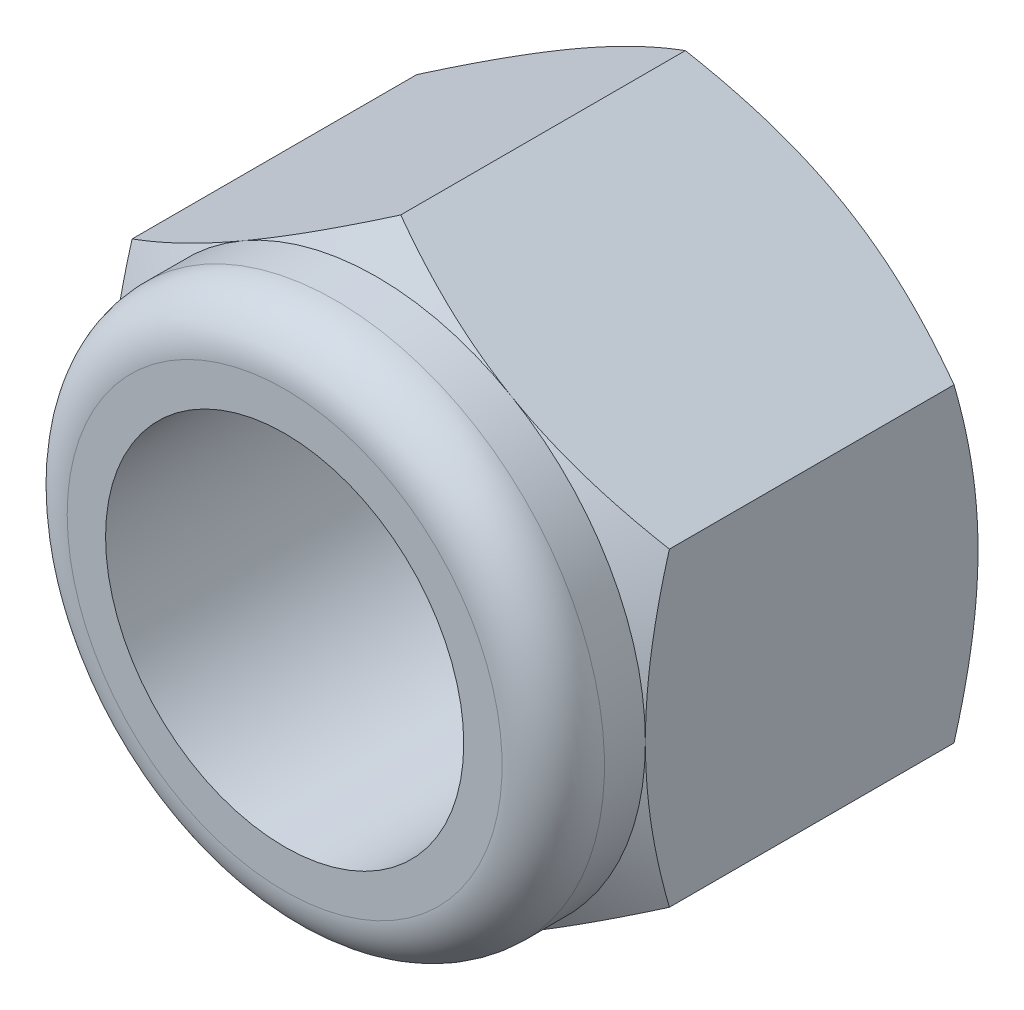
ISO-10303-21;
HEADER;
FILE_DESCRIPTION(('STEP AP214'),'2;1');
FILE_NAME('part.step','',(''),(''),'','','');
FILE_SCHEMA(('AUTOMOTIVE_DESIGN { 1 0 10303 214 1 1 1 1 }'));
ENDSEC;
DATA;
#1=APPLICATION_CONTEXT('core data for automotive mechanical design processes');
#2=APPLICATION_PROTOCOL_DEFINITION('international standard','automotive_design',2000,#1);
#3=PRODUCT_CONTEXT('',#1,'mechanical');
#4=PRODUCT('Part','Part','',(#3));
#5=PRODUCT_RELATED_PRODUCT_CATEGORY('part','',(#4));
#6=PRODUCT_DEFINITION_FORMATION('','',#4);
#7=PRODUCT_DEFINITION_CONTEXT('part definition',#1,'design');
#8=PRODUCT_DEFINITION('design','',#6,#7);
#9=PRODUCT_DEFINITION_SHAPE('','',#8);
#10=(LENGTH_UNIT() NAMED_UNIT(*) SI_UNIT(.MILLI.,.METRE.));
#11=(NAMED_UNIT(*) PLANE_ANGLE_UNIT() SI_UNIT($,.RADIAN.));
#12=(NAMED_UNIT(*) SI_UNIT($,.STERADIAN.) SOLID_ANGLE_UNIT());
#13=UNCERTAINTY_MEASURE_WITH_UNIT(LENGTH_MEASURE(1.E-05),#10,'distance_accuracy_value','');
#14=(GEOMETRIC_REPRESENTATION_CONTEXT(3) GLOBAL_UNCERTAINTY_ASSIGNED_CONTEXT((#13)) GLOBAL_UNIT_ASSIGNED_CONTEXT((#10,
#11,#12)) REPRESENTATION_CONTEXT('',''));
#15=CARTESIAN_POINT('',(0.,0.,0.));
#16=DIRECTION('',(0.,0.,1.));
#17=DIRECTION('',(1.,0.,0.));
#18=AXIS2_PLACEMENT_3D('',#15,#16,#17);
#19=CARTESIAN_POINT('',(-3.33066907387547E-13,8.32667268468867E-13,-4.44089209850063E-13));
#20=DIRECTION('',(0.,0.,-0.999999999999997));
#21=DIRECTION('',(-1.,0.,0.));
#22=AXIS2_PLACEMENT_3D('',#19,#20,#21);
#23=CONICAL_SURFACE('',#22,10.5,1.0471975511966);
#24=CARTESIAN_POINT('',(-10.5000000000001,-16.4007127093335,-5.18109241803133));
#25=CARTESIAN_POINT('',(-10.5000000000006,-16.1708904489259,-5.06934630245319));
#26=CARTESIAN_POINT('',(-10.5000000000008,-15.9408016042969,-4.95814870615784));
#27=CARTESIAN_POINT('',(-10.5000000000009,-15.4800351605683,-4.73697457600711));
#28=CARTESIAN_POINT('',(-10.5000000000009,-15.2493575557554,-4.62699805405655));
#29=CARTESIAN_POINT('',(-10.5000000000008,-14.556298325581,-4.29905786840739));
#30=CARTESIAN_POINT('',(-10.5000000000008,-14.0929565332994,-4.08311588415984));
#31=CARTESIAN_POINT('',(-10.5000000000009,-13.1607452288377,-3.65676984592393));
#32=CARTESIAN_POINT('',(-10.5000000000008,-12.6918594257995,-3.44640132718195));
#33=CARTESIAN_POINT('',(-10.5000000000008,-11.7503992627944,-3.03411702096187));
#34=CARTESIAN_POINT('',(-10.5000000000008,-11.2778250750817,-2.83220084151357));
#35=CARTESIAN_POINT('',(-10.5000000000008,-10.3126678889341,-2.43260932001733));
#36=CARTESIAN_POINT('',(-10.5000000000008,-9.81993674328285,-2.23528987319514));
#37=CARTESIAN_POINT('',(-10.5000000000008,-8.82875484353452,-1.85530331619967));
#38=CARTESIAN_POINT('',(-10.5000000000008,-8.33030346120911,-1.67263783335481));
#39=CARTESIAN_POINT('',(-10.5000000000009,-7.32777702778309,-1.3266688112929));
#40=CARTESIAN_POINT('',(-10.5000000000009,-6.82371529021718,-1.16332710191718));
#41=CARTESIAN_POINT('',(-10.5000000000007,-5.80838055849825,-0.861166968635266));
#42=CARTESIAN_POINT('',(-10.5000000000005,-5.29710985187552,-0.722340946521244));
#43=CARTESIAN_POINT('',(-10.5000000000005,-4.26977581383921,-0.476532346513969));
#44=CARTESIAN_POINT('',(-10.5000000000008,-3.75375500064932,-0.369376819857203));
#45=CARTESIAN_POINT('',(-10.5000000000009,-2.97493321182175,-0.236990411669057));
#46=CARTESIAN_POINT('',(-10.5000000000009,-2.71450967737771,-0.197584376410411));
#47=CARTESIAN_POINT('',(-10.5000000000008,-2.1923287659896,-0.128991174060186));
#48=CARTESIAN_POINT('',(-10.5000000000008,-1.93057152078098,-0.0998030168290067));
#49=CARTESIAN_POINT('',(-10.5000000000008,-1.40954656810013,-0.0525995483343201));
#50=CARTESIAN_POINT('',(-10.5000000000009,-1.15029187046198,-0.0344412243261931));
#51=CARTESIAN_POINT('',(-10.5000000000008,-0.631246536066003,-0.00911007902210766));
#52=CARTESIAN_POINT('',(-10.5000000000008,-0.371455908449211,-0.0019370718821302));
#53=CARTESIAN_POINT('',(-10.5000000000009,0.148197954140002,0.00125191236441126));
#54=CARTESIAN_POINT('',(-10.5000000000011,0.408061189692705,-0.00273220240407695));
#55=CARTESIAN_POINT('',(-10.5000000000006,0.927385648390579,-0.0217587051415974));
#56=CARTESIAN_POINT('',(-10.4999999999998,1.18684685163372,-0.0368016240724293));
#57=CARTESIAN_POINT('',(-10.4999999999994,1.80678181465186,-0.0856342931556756));
#58=CARTESIAN_POINT('',(-10.5000000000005,2.1668668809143,-0.124469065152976));
#59=CARTESIAN_POINT('',(-10.5000000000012,2.8844248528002,-0.221347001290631));
#60=CARTESIAN_POINT('',(-10.500000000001,3.24189741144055,-0.279392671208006));
#61=CARTESIAN_POINT('',(-10.5000000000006,4.30994364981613,-0.479272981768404));
#62=CARTESIAN_POINT('',(-10.5000000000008,5.01577284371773,-0.646817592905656));
#63=CARTESIAN_POINT('',(-10.5000000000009,6.07156577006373,-0.938185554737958));
#64=CARTESIAN_POINT('',(-10.5000000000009,6.42697994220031,-1.04340092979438));
#65=CARTESIAN_POINT('',(-10.5000000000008,7.1343570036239,-1.26495925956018));
#66=CARTESIAN_POINT('',(-10.5000000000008,7.48631986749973,-1.38130229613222));
#67=CARTESIAN_POINT('',(-10.5000000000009,8.18690465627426,-1.62323237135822));
#68=CARTESIAN_POINT('',(-10.500000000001,8.53552756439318,-1.74881658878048));
#69=CARTESIAN_POINT('',(-10.5000000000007,9.22986802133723,-2.00773117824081));
#70=CARTESIAN_POINT('',(-10.5000000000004,9.57558562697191,-2.14106139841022));
#71=CARTESIAN_POINT('',(-10.5000000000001,10.4764376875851,-2.49822999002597));
#72=CARTESIAN_POINT('',(-10.5000000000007,11.0295077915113,-2.72726913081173));
#73=CARTESIAN_POINT('',(-10.500000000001,12.1302293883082,-3.19806058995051));
#74=CARTESIAN_POINT('',(-10.5000000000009,12.6778803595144,-3.4398141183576));
#75=CARTESIAN_POINT('',(-10.5000000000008,13.7689504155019,-3.93313652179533));
#76=CARTESIAN_POINT('',(-10.5000000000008,14.3123680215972,-4.18470865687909));
#77=CARTESIAN_POINT('',(-10.5000000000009,15.3956066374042,-4.69540948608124));
#78=CARTESIAN_POINT('',(-10.5000000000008,15.9354277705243,-4.95453791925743));
#79=CARTESIAN_POINT('',(-10.5000000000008,17.0129414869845,-5.4791429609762));
#80=CARTESIAN_POINT('',(-10.5000000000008,17.550629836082,-5.74462824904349));
#81=CARTESIAN_POINT('',(-10.5000000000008,18.6236172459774,-6.28038566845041));
#82=CARTESIAN_POINT('',(-10.5000000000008,19.158916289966,-6.55065783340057));
#83=CARTESIAN_POINT('',(-10.5000000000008,20.2274346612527,-7.0950249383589));
#84=CARTESIAN_POINT('',(-10.5000000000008,20.7606543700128,-7.36911913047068));
#85=CARTESIAN_POINT('',(-10.5000000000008,21.825447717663,-7.92048814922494));
#86=CARTESIAN_POINT('',(-10.5000000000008,22.3570213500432,-8.19776298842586));
#87=CARTESIAN_POINT('',(-10.5000000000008,23.8434768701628,-8.9777910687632));
#88=CARTESIAN_POINT('',(-10.5000000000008,24.7968174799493,-9.48348096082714));
#89=CARTESIAN_POINT('',(-10.5000000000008,26.7002349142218,-10.5010739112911));
#90=CARTESIAN_POINT('',(-10.5000000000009,27.6503115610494,-11.0129773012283));
#91=CARTESIAN_POINT('',(-10.5000000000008,29.5450014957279,-12.0398558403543));
#92=CARTESIAN_POINT('',(-10.5000000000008,30.4896225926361,-12.5548165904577));
#93=CARTESIAN_POINT('',(-10.5000000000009,31.9050523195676,-13.3299181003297));
#94=CARTESIAN_POINT('',(-10.5000000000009,32.3765953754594,-13.5887195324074));
#95=CARTESIAN_POINT('',(-10.5000000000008,33.3192434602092,-14.1071175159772));
#96=CARTESIAN_POINT('',(-10.5000000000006,33.7903484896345,-14.3667140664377));
#97=CARTESIAN_POINT('',(-10.5000000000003,34.2612608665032,-14.6266597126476));
#98=B_SPLINE_CURVE_WITH_KNOTS('',3,(#24,#25,#26,#27,#28,#29,#30,#31,#32,#33,#34,#35,#36,#37,#38,
#39,#40,#41,#42,#43,#44,#45,#46,#47,#48,#49,#50,#51,#52,#53,#54,#55,#56,#57,#58,#59,#60,#61,#62,
#63,#64,#65,#66,#67,#68,#69,#70,#71,#72,#73,#74,#75,#76,#77,#78,#79,#80,#81,#82,#83,#84,#85,#86,
#87,#88,#89,#90,#91,#92,#93,#94,#95,#96,#97),.UNSPECIFIED.,.F.,.F.,(4,2,2,2,2,2,2,2,2,2,2,2,2,2,
2,2,2,2,2,2,2,2,2,2,2,2,2,2,2,2,2,2,2,2,2,2,4),(0.,0.766646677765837,1.53330082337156,
3.06683021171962,4.60851049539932,6.15011920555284,7.74225443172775,9.33456622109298,
10.9236782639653,12.5122969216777,14.0920728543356,14.8820680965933,15.6719867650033,
16.4514316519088,17.2308633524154,18.0103014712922,18.7897770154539,19.875685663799,
20.9617360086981,23.134955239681,24.2468419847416,25.3587369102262,26.4702937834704,
27.5818288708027,29.3774555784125,31.1732534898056,32.9696528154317,34.7659901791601,
36.5649384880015,38.3638994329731,40.1625131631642,41.9611339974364,45.1985704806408,
48.4361804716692,51.6637760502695,53.2774605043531,54.8911428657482),.UNSPECIFIED.);
#99=CARTESIAN_POINT('',(-10.4999999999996,6.0621778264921,-0.937822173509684));
#100=VERTEX_POINT('',#99);
#101=CARTESIAN_POINT('',(-10.5000000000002,8.88178419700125E-13,-1.11022302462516E-12));
#102=VERTEX_POINT('',#101);
#103=EDGE_CURVE('E254',#100,#102,#98,.F.);
#104=ORIENTED_EDGE('',*,*,#103,.T.);
#105=CARTESIAN_POINT('',(-3.33066907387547E-13,8.32667268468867E-13,-4.44089209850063E-13));
#106=DIRECTION('',(0.,0.,-0.999999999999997));
#107=DIRECTION('',(-1.,0.,0.));
#108=AXIS2_PLACEMENT_3D('',#105,#106,#107);
#109=CIRCLE('',#108,10.5);
#110=CARTESIAN_POINT('',(-5.24999999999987,9.0932667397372,6.66133814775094E-13));
#111=VERTEX_POINT('',#110);
#112=EDGE_CURVE('E156',#102,#111,#109,.T.);
#113=ORIENTED_EDGE('',*,*,#112,.T.);
#114=CARTESIAN_POINT('',(0.000200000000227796,12.1244711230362,-0.937888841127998));
#115=CARTESIAN_POINT('',(-0.230612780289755,11.9912113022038,-0.860963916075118));
#116=CARTESIAN_POINT('',(-0.462286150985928,11.8574546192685,-0.787530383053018));
#117=CARTESIAN_POINT('',(-0.927490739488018,11.5888686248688,-0.648614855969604));
#118=CARTESIAN_POINT('',(-1.16102254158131,11.4540389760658,-0.583135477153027));
#119=CARTESIAN_POINT('',(-1.8653808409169,11.0473775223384,-0.399895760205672));
#120=CARTESIAN_POINT('',(-2.33898788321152,10.7739403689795,-0.295669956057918));
#121=CARTESIAN_POINT('',(-3.04771913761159,10.3647541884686,-0.173455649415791));
#122=CARTESIAN_POINT('',(-3.28072597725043,10.2302276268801,-0.138641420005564));
#123=CARTESIAN_POINT('',(-3.74781845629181,9.96055165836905,-0.0802602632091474));
#124=CARTESIAN_POINT('',(-3.98190411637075,9.825402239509,-0.0566935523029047));
#125=CARTESIAN_POINT('',(-4.45046590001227,9.55487796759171,-0.021411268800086));
#126=CARTESIAN_POINT('',(-4.68494122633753,9.41950357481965,-0.00968161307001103));
#127=CARTESIAN_POINT('',(-5.15410845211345,9.14862975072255,0.00167731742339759));
#128=CARTESIAN_POINT('',(-5.38880034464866,9.01313032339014,0.00130696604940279));
#129=CARTESIAN_POINT('',(-5.82756124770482,8.75981159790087,-0.0106922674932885));
#130=CARTESIAN_POINT('',(-6.03166122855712,8.64197441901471,-0.0208573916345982));
#131=CARTESIAN_POINT('',(-6.43938384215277,8.40657565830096,-0.05014160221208));
#132=CARTESIAN_POINT('',(-6.64300644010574,8.28901409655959,-0.0692613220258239));
#133=CARTESIAN_POINT('',(-7.25308524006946,7.93678493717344,-0.139600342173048));
#134=CARTESIAN_POINT('',(-7.65846156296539,7.70274080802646,-0.203790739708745));
#135=CARTESIAN_POINT('',(-8.47351422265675,7.23216993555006,-0.364267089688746));
#136=CARTESIAN_POINT('',(-8.88308654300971,6.99570324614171,-0.461233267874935));
#137=CARTESIAN_POINT('',(-9.69612354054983,6.52629611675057,-0.681306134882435));
#138=CARTESIAN_POINT('',(-10.0995986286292,6.29334966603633,-0.804361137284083));
#139=CARTESIAN_POINT('',(-10.5001999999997,6.06206235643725,-0.937888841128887));
#140=B_SPLINE_CURVE_WITH_KNOTS('',3,(#114,#115,#116,#117,#118,#119,#120,#121,#122,#123,#124,
#125,#126,#127,#128,#129,#130,#131,#132,#133,#134,#135,#136,#137,#138,#139),.UNSPECIFIED.,.F.,
.F.,(4,2,2,2,2,2,2,2,2,2,2,2,4),(0.,0.832130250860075,1.6645333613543,3.33288308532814,
4.14658222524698,4.96029702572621,5.77304256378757,6.58576298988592,7.29326708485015,
8.00082123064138,9.41693497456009,10.8644544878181,12.3091325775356),.UNSPECIFIED.);
#141=EDGE_CURVE('E246',#111,#100,#140,.T.);
#142=ORIENTED_EDGE('',*,*,#141,.T.);
#143=EDGE_LOOP('',(#104,#113,#142));
#144=FACE_BOUND('',#143,.T.);
#145=ADVANCED_FACE('F32',(#144),#23,.T.);
#146=CARTESIAN_POINT('',(10.5002,6.06206235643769,-0.93788884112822));
#147=CARTESIAN_POINT('',(10.2693872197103,6.19532217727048,-0.860963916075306));
#148=CARTESIAN_POINT('',(10.0377138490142,6.32907886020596,-0.787530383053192));
#149=CARTESIAN_POINT('',(9.57250926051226,6.59766485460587,-0.648614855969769));
#150=CARTESIAN_POINT('',(9.33897745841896,6.73249450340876,-0.583135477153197));
#151=CARTESIAN_POINT('',(8.63461915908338,7.13915595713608,-0.399895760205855));
#152=CARTESIAN_POINT('',(8.16101211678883,7.41259311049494,-0.295669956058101));
#153=CARTESIAN_POINT('',(7.45228086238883,7.8217792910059,-0.173455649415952));
#154=CARTESIAN_POINT('',(7.21927402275,7.95630585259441,-0.138641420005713));
#155=CARTESIAN_POINT('',(6.75218154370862,8.22598182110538,-0.0802602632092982));
#156=CARTESIAN_POINT('',(6.51809588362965,8.36113123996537,-0.0566935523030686));
#157=CARTESIAN_POINT('',(6.04953409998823,8.63165551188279,-0.021411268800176));
#158=CARTESIAN_POINT('',(5.81505877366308,8.76702990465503,-0.0096816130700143));
#159=CARTESIAN_POINT('',(5.34589154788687,9.03790372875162,0.00167731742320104));
#160=CARTESIAN_POINT('',(5.11119965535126,9.17340315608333,0.00130696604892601));
#161=CARTESIAN_POINT('',(4.67243875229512,9.42672188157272,-0.010692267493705));
#162=CARTESIAN_POINT('',(4.46833877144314,9.54455906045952,-0.0208573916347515));
#163=CARTESIAN_POINT('',(4.0606161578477,9.77995782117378,-0.0501416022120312));
#164=CARTESIAN_POINT('',(3.85699355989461,9.89751938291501,-0.0692613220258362));
#165=CARTESIAN_POINT('',(3.24691475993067,10.249748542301,-0.139600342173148));
#166=CARTESIAN_POINT('',(2.84153843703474,10.4837926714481,-0.203790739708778));
#167=CARTESIAN_POINT('',(2.02648577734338,10.9543635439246,-0.364267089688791));
#168=CARTESIAN_POINT('',(1.61691345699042,11.190830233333,-0.461233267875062));
#169=CARTESIAN_POINT('',(0.803876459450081,11.6602373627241,-0.681306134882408));
#170=CARTESIAN_POINT('',(0.400401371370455,11.8931838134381,-0.804361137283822));
#171=CARTESIAN_POINT('',(-0.00020000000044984,12.1244711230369,-0.937888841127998));
#172=B_SPLINE_CURVE_WITH_KNOTS('',3,(#146,#147,#148,#149,#150,#151,#152,#153,#154,#155,#156,
#157,#158,#159,#160,#161,#162,#163,#164,#165,#166,#167,#168,#169,#170,#171),.UNSPECIFIED.,.F.,
.F.,(4,2,2,2,2,2,2,2,2,2,2,2,4),(0.,0.83213025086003,1.6645333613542,3.33288308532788,
4.1465822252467,4.9602970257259,5.77304256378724,6.58576298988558,7.29326708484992,
8.00082123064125,9.41693497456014,10.8644544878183,12.3091325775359),.UNSPECIFIED.);
#173=CARTESIAN_POINT('',(5.24999999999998,9.09326673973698,-6.66133814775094E-13));
#174=VERTEX_POINT('',#173);
#175=CARTESIAN_POINT('',(-4.44089209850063E-13,12.1243556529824,-0.937822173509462));
#176=VERTEX_POINT('',#175);
#177=EDGE_CURVE('E260',#174,#176,#172,.T.);
#178=ORIENTED_EDGE('',*,*,#177,.T.);
#179=EDGE_CURVE('E268',#176,#111,#140,.T.);
#180=ORIENTED_EDGE('',*,*,#179,.T.);
#181=CARTESIAN_POINT('',(-3.33066907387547E-13,8.32667268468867E-13,-4.44089209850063E-13));
#182=DIRECTION('',(0.,0.,-0.999999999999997));
#183=DIRECTION('',(-1.,0.,0.));
#184=AXIS2_PLACEMENT_3D('',#181,#182,#183);
#185=CIRCLE('',#184,10.5);
#186=EDGE_CURVE('E157',#174,#111,#185,.F.);
#187=ORIENTED_EDGE('',*,*,#186,.F.);
#188=EDGE_LOOP('',(#178,#180,#187));
#189=FACE_BOUND('',#188,.T.);
#190=ADVANCED_FACE('F239',(#189),#23,.T.);
#191=CARTESIAN_POINT('',(10.5000000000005,-16.400712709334,-5.18109241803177));
#192=CARTESIAN_POINT('',(10.5000000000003,-16.1708904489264,-5.06934630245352));
#193=CARTESIAN_POINT('',(10.5000000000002,-15.9408016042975,-4.95814870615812));
#194=CARTESIAN_POINT('',(10.5000000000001,-15.4800351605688,-4.73697457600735));
#195=CARTESIAN_POINT('',(10.5000000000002,-15.2493575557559,-4.62699805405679));
#196=CARTESIAN_POINT('',(10.5000000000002,-14.5562983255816,-4.29905786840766));
#197=CARTESIAN_POINT('',(10.5000000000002,-14.0929565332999,-4.08311588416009));
#198=CARTESIAN_POINT('',(10.5000000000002,-13.1607452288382,-3.65676984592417));
#199=CARTESIAN_POINT('',(10.5000000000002,-12.6918594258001,-3.44640132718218));
#200=CARTESIAN_POINT('',(10.5000000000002,-11.7503992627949,-3.03411702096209));
#201=CARTESIAN_POINT('',(10.5000000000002,-11.2778250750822,-2.83220084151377));
#202=CARTESIAN_POINT('',(10.5000000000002,-10.3126678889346,-2.43260932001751));
#203=CARTESIAN_POINT('',(10.5000000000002,-9.81993674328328,-2.23528987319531));
#204=CARTESIAN_POINT('',(10.5000000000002,-8.8287548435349,-1.85530331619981));
#205=CARTESIAN_POINT('',(10.5000000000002,-8.33030346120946,-1.67263783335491));
#206=CARTESIAN_POINT('',(10.5000000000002,-7.32777702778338,-1.32666881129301));
#207=CARTESIAN_POINT('',(10.5000000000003,-6.82371529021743,-1.16332710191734));
#208=CARTESIAN_POINT('',(10.5000000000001,-5.8083805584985,-0.861166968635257));
#209=CARTESIAN_POINT('',(10.4999999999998,-5.29710985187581,-0.722340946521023));
#210=CARTESIAN_POINT('',(10.4999999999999,-4.26977581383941,-0.476532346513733));
#211=CARTESIAN_POINT('',(10.5000000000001,-3.7537550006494,-0.369376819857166));
#212=CARTESIAN_POINT('',(10.5000000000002,-2.97493321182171,-0.236990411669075));
#213=CARTESIAN_POINT('',(10.5000000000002,-2.71450967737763,-0.197584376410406));
#214=CARTESIAN_POINT('',(10.5000000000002,-2.19232876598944,-0.12899117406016));
#215=CARTESIAN_POINT('',(10.5000000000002,-1.93057152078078,-0.0998030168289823));
#216=CARTESIAN_POINT('',(10.5000000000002,-1.40954656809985,-0.0525995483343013));
#217=CARTESIAN_POINT('',(10.5000000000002,-1.15029187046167,-0.0344412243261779));
#218=CARTESIAN_POINT('',(10.5000000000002,-0.631246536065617,-0.00911007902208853));
#219=CARTESIAN_POINT('',(10.5000000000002,-0.371455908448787,-0.00193707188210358));
#220=CARTESIAN_POINT('',(10.5000000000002,0.148197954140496,0.00125191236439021));
#221=CARTESIAN_POINT('',(10.5000000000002,0.40806118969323,-0.002732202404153));
#222=CARTESIAN_POINT('',(10.5000000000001,0.927385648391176,-0.0217587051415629));
#223=CARTESIAN_POINT('',(10.5000000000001,1.18684685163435,-0.0368016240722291));
#224=CARTESIAN_POINT('',(10.5,1.8067818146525,-0.0856342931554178));
#225=CARTESIAN_POINT('',(10.5000000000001,2.16686688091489,-0.124469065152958));
#226=CARTESIAN_POINT('',(10.5000000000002,2.88442485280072,-0.2213470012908));
#227=CARTESIAN_POINT('',(10.5000000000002,3.24189741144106,-0.279392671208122));
#228=CARTESIAN_POINT('',(10.5000000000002,4.30994364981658,-0.479272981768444));
#229=CARTESIAN_POINT('',(10.5000000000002,5.01577284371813,-0.646817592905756));
#230=CARTESIAN_POINT('',(10.5000000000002,6.07156577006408,-0.93818555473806));
#231=CARTESIAN_POINT('',(10.5000000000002,6.42697994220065,-1.04340092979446));
#232=CARTESIAN_POINT('',(10.5000000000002,7.1343570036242,-1.2649592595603));
#233=CARTESIAN_POINT('',(10.5000000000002,7.4863198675,-1.38130229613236));
#234=CARTESIAN_POINT('',(10.5000000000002,8.18690465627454,-1.62323237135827));
#235=CARTESIAN_POINT('',(10.5000000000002,8.5355275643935,-1.74881658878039));
#236=CARTESIAN_POINT('',(10.5000000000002,9.22986802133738,-2.00773117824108));
#237=CARTESIAN_POINT('',(10.5000000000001,9.57558562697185,-2.14106139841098));
#238=CARTESIAN_POINT('',(10.5,10.4764376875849,-2.49822999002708));
#239=CARTESIAN_POINT('',(10.5000000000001,11.0295077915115,-2.72726913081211));
#240=CARTESIAN_POINT('',(10.5000000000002,12.1302293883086,-3.19806058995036));
#241=CARTESIAN_POINT('',(10.5000000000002,12.6778803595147,-3.43981411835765));
#242=CARTESIAN_POINT('',(10.5000000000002,13.7689504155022,-3.93313652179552));
#243=CARTESIAN_POINT('',(10.5000000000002,14.3123680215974,-4.18470865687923));
#244=CARTESIAN_POINT('',(10.5000000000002,15.3956066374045,-4.69540948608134));
#245=CARTESIAN_POINT('',(10.5000000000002,15.9354277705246,-4.95453791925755));
#246=CARTESIAN_POINT('',(10.5000000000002,17.0129414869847,-5.47914296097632));
#247=CARTESIAN_POINT('',(10.5000000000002,17.5506298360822,-5.74462824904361));
#248=CARTESIAN_POINT('',(10.5000000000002,18.6236172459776,-6.28038566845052));
#249=CARTESIAN_POINT('',(10.5000000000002,19.1589162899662,-6.55065783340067));
#250=CARTESIAN_POINT('',(10.5000000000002,20.2274346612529,-7.095024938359));
#251=CARTESIAN_POINT('',(10.5000000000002,20.760654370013,-7.36911913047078));
#252=CARTESIAN_POINT('',(10.5000000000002,21.8254477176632,-7.92048814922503));
#253=CARTESIAN_POINT('',(10.5000000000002,22.3570213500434,-8.19776298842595));
#254=CARTESIAN_POINT('',(10.5000000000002,23.8434768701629,-8.97779106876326));
#255=CARTESIAN_POINT('',(10.5000000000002,24.7968174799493,-9.48348096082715));
#256=CARTESIAN_POINT('',(10.5000000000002,26.7002349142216,-10.5010739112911));
#257=CARTESIAN_POINT('',(10.5000000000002,27.6503115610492,-11.0129773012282));
#258=CARTESIAN_POINT('',(10.5000000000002,29.5450014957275,-12.0398558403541));
#259=CARTESIAN_POINT('',(10.5000000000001,30.4896225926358,-12.5548165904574));
#260=CARTESIAN_POINT('',(10.5000000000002,31.9050523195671,-13.3299181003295));
#261=CARTESIAN_POINT('',(10.5000000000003,32.3765953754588,-13.5887195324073));
#262=CARTESIAN_POINT('',(10.5000000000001,33.3192434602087,-14.1071175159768));
#263=CARTESIAN_POINT('',(10.4999999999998,33.7903484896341,-14.3667140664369));
#264=CARTESIAN_POINT('',(10.4999999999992,34.2612608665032,-14.6266597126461));
#265=B_SPLINE_CURVE_WITH_KNOTS('',3,(#191,#192,#193,#194,#195,#196,#197,#198,#199,#200,#201,
#202,#203,#204,#205,#206,#207,#208,#209,#210,#211,#212,#213,#214,#215,#216,#217,#218,#219,#220,
#221,#222,#223,#224,#225,#226,#227,#228,#229,#230,#231,#232,#233,#234,#235,#236,#237,#238,#239,
#240,#241,#242,#243,#244,#245,#246,#247,#248,#249,#250,#251,#252,#253,#254,#255,#256,#257,#258,
#259,#260,#261,#262,#263,#264),.UNSPECIFIED.,.F.,.F.,(4,2,2,2,2,2,2,2,2,2,2,2,2,2,2,2,2,2,2,2,2,
2,2,2,2,2,2,2,2,2,2,2,2,2,2,2,4),(0.,0.766646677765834,1.53330082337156,3.06683021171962,
4.60851049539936,6.15011920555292,7.74225443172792,9.33456622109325,10.9236782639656,
12.5122969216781,14.0920728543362,14.8820680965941,15.6719867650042,16.4514316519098,
17.2308633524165,18.0103014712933,18.7897770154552,19.8756856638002,20.9617360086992,
23.134955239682,24.2468419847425,25.3587369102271,26.4702937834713,27.5818288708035,
29.3774555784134,31.1732534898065,32.9696528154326,34.765990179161,36.5649384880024,
38.3638994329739,40.162513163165,41.9611339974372,45.1985704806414,48.4361804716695,
51.6637760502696,53.277460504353,54.8911428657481),.UNSPECIFIED.);
#266=CARTESIAN_POINT('',(10.4999999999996,3.33066907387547E-13,8.88178419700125E-13));
#267=VERTEX_POINT('',#266);
#268=CARTESIAN_POINT('',(10.4999999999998,6.06217782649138,-0.937822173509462));
#269=VERTEX_POINT('',#268);
#270=EDGE_CURVE('E152',#267,#269,#265,.T.);
#271=ORIENTED_EDGE('',*,*,#270,.T.);
#272=EDGE_CURVE('E264',#269,#174,#172,.T.);
#273=ORIENTED_EDGE('',*,*,#272,.T.);
#274=EDGE_CURVE('E161',#267,#174,#185,.F.);
#275=ORIENTED_EDGE('',*,*,#274,.F.);
#276=EDGE_LOOP('',(#271,#273,#275));
#277=FACE_BOUND('',#276,.T.);
#278=ADVANCED_FACE('F363',(#277),#23,.T.);
#279=CARTESIAN_POINT('',(-0.000200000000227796,-12.1244711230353,-0.937888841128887));
#280=CARTESIAN_POINT('',(0.230612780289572,-11.9912113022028,-0.860963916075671));
#281=CARTESIAN_POINT('',(0.462286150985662,-11.8574546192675,-0.787530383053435));
#282=CARTESIAN_POINT('',(0.92749073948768,-11.5888686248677,-0.648614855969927));
#283=CARTESIAN_POINT('',(1.16102254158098,-11.4540389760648,-0.583135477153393));
#284=CARTESIAN_POINT('',(1.86538084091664,-11.0473775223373,-0.399895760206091));
#285=CARTESIAN_POINT('',(2.33898788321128,-10.7739403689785,-0.295669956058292));
#286=CARTESIAN_POINT('',(3.04771913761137,-10.3647541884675,-0.173455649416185));
#287=CARTESIAN_POINT('',(3.2807259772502,-10.230227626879,-0.138641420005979));
#288=CARTESIAN_POINT('',(3.74781845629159,-9.96055165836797,-0.0802602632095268));
#289=CARTESIAN_POINT('',(3.98190411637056,-9.82540223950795,-0.0566935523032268));
#290=CARTESIAN_POINT('',(4.45046590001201,-9.55487796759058,-0.0214112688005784));
#291=CARTESIAN_POINT('',(4.68494122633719,-9.41950357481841,-0.00968161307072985));
#292=CARTESIAN_POINT('',(5.15410845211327,-9.14862975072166,0.00167731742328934));
#293=CARTESIAN_POINT('',(5.38880034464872,-9.01313032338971,0.00130696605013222));
#294=CARTESIAN_POINT('',(5.82756124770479,-8.7598115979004,-0.0106922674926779));
#295=CARTESIAN_POINT('',(6.03166122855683,-8.64197441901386,-0.0208573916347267));
#296=CARTESIAN_POINT('',(6.43938384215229,-8.40657565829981,-0.0501416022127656));
#297=CARTESIAN_POINT('',(6.64300644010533,-8.28901409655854,-0.0692613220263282));
#298=CARTESIAN_POINT('',(7.2530852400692,-7.93678493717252,-0.139600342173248));
#299=CARTESIAN_POINT('',(7.65846156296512,-7.70274080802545,-0.203790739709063));
#300=CARTESIAN_POINT('',(8.47351422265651,-7.23216993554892,-0.364267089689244));
#301=CARTESIAN_POINT('',(8.8830865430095,-6.99570324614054,-0.461233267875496));
#302=CARTESIAN_POINT('',(9.69612354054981,-6.52629611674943,-0.681306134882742));
#303=CARTESIAN_POINT('',(10.0995986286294,-6.29334966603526,-0.804361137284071));
#304=CARTESIAN_POINT('',(10.5002000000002,-6.0620623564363,-0.93788884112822));
#305=B_SPLINE_CURVE_WITH_KNOTS('',3,(#279,#280,#281,#282,#283,#284,#285,#286,#287,#288,#289,
#290,#291,#292,#293,#294,#295,#296,#297,#298,#299,#300,#301,#302,#303,#304),.UNSPECIFIED.,.F.,
.F.,(4,2,2,2,2,2,2,2,2,2,2,2,4),(0.,0.832130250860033,1.66453336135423,3.3328830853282,
4.14658222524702,4.96029702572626,5.77304256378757,6.58576298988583,7.29326708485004,
8.0008212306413,9.41693497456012,10.8644544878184,12.3091325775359),.UNSPECIFIED.);
#306=CARTESIAN_POINT('',(5.2500000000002,-9.0932667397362,-1.11022302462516E-12));
#307=VERTEX_POINT('',#306);
#308=CARTESIAN_POINT('',(10.5000000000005,-6.06217782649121,-0.937822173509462));
#309=VERTEX_POINT('',#308);
#310=EDGE_CURVE('E134',#307,#309,#305,.T.);
#311=ORIENTED_EDGE('',*,*,#310,.T.);
#312=EDGE_CURVE('E135',#309,#267,#265,.T.);
#313=ORIENTED_EDGE('',*,*,#312,.T.);
#314=EDGE_CURVE('E146',#307,#267,#185,.F.);
#315=ORIENTED_EDGE('',*,*,#314,.F.);
#316=EDGE_LOOP('',(#311,#313,#315));
#317=FACE_BOUND('',#316,.T.);
#318=ADVANCED_FACE('F368',(#317),#23,.T.);
#319=CARTESIAN_POINT('',(1.11022302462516E-13,-12.1243556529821,-0.937822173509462));
#320=VERTEX_POINT('',#319);
#321=EDGE_CURVE('E140',#320,#307,#305,.T.);
#322=ORIENTED_EDGE('',*,*,#321,.T.);
#323=CARTESIAN_POINT('',(-5.25000000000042,-9.09326673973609,-4.44089209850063E-13));
#324=VERTEX_POINT('',#323);
#325=EDGE_CURVE('E138',#324,#307,#185,.F.);
#326=ORIENTED_EDGE('',*,*,#325,.F.);
#327=CARTESIAN_POINT('',(-10.5002000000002,-6.06206235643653,-0.937888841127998));
#328=CARTESIAN_POINT('',(-10.2693872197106,-6.1953221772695,-0.860963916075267));
#329=CARTESIAN_POINT('',(-10.0377138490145,-6.32907886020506,-0.78753038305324));
#330=CARTESIAN_POINT('',(-9.57250926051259,-6.59766485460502,-0.648614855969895));
#331=CARTESIAN_POINT('',(-9.33897745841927,-6.7324945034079,-0.583135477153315));
#332=CARTESIAN_POINT('',(-8.63461915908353,-7.13915595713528,-0.399895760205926));
#333=CARTESIAN_POINT('',(-8.16101211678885,-7.41259311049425,-0.295669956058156));
#334=CARTESIAN_POINT('',(-7.4522808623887,-7.82177929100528,-0.173455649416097));
#335=CARTESIAN_POINT('',(-7.21927402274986,-7.95630585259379,-0.138641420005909));
#336=CARTESIAN_POINT('',(-6.75218154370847,-8.22598182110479,-0.0802602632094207));
#337=CARTESIAN_POINT('',(-6.51809588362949,-8.36113123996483,-0.0566935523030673));
#338=CARTESIAN_POINT('',(-6.04953409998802,-8.63165551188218,-0.0214112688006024));
#339=CARTESIAN_POINT('',(-5.81505877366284,-8.76702990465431,-0.00968161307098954));
#340=CARTESIAN_POINT('',(-5.34589154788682,-9.03790372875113,0.00167731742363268));
#341=CARTESIAN_POINT('',(-5.11119965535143,-9.17340315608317,0.00130696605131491));
#342=CARTESIAN_POINT('',(-4.67243875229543,-9.42672188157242,-0.0106922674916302));
#343=CARTESIAN_POINT('',(-4.4683387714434,-9.54455906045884,-0.0208573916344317));
#344=CARTESIAN_POINT('',(-4.06061615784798,-9.77995782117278,-0.0501416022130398));
#345=CARTESIAN_POINT('',(-3.85699355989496,-9.89751938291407,-0.0692613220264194));
#346=CARTESIAN_POINT('',(-3.24691475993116,-10.2497485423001,-0.139600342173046));
#347=CARTESIAN_POINT('',(-2.84153843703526,-10.4837926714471,-0.203790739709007));
#348=CARTESIAN_POINT('',(-2.0264857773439,-10.9543635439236,-0.364267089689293));
#349=CARTESIAN_POINT('',(-1.61691345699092,-11.190830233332,-0.461233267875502));
#350=CARTESIAN_POINT('',(-0.803876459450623,-11.6602373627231,-0.681306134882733));
#351=CARTESIAN_POINT('',(-0.400401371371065,-11.8931838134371,-0.804361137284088));
#352=CARTESIAN_POINT('',(0.000199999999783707,-12.1244711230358,-0.937888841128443));
#353=B_SPLINE_CURVE_WITH_KNOTS('',3,(#327,#328,#329,#330,#331,#332,#333,#334,#335,#336,#337,
#338,#339,#340,#341,#342,#343,#344,#345,#346,#347,#348,#349,#350,#351,#352),.UNSPECIFIED.,.F.,
.F.,(4,2,2,2,2,2,2,2,2,2,2,2,4),(0.,0.832130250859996,1.66453336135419,3.33288308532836,
4.14658222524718,4.96029702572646,5.77304256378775,6.58576298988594,7.29326708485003,
8.00082123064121,9.41693497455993,10.8644544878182,12.3091325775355),.UNSPECIFIED.);
#354=EDGE_CURVE('E123',#324,#320,#353,.T.);
#355=ORIENTED_EDGE('',*,*,#354,.T.);
#356=EDGE_LOOP('',(#322,#326,#355));
#357=FACE_BOUND('',#356,.T.);
#358=ADVANCED_FACE('F139',(#357),#23,.T.);
#359=CARTESIAN_POINT('',(-10.5000000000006,-6.0621778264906,-0.93782217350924));
#360=VERTEX_POINT('',#359);
#361=EDGE_CURVE('E128',#360,#324,#353,.T.);
#362=ORIENTED_EDGE('',*,*,#361,.T.);
#363=EDGE_CURVE('E145',#102,#324,#185,.F.);
#364=ORIENTED_EDGE('',*,*,#363,.F.);
#365=EDGE_CURVE('E151',#102,#360,#98,.F.);
#366=ORIENTED_EDGE('',*,*,#365,.T.);
#367=EDGE_LOOP('',(#362,#364,#366));
#368=FACE_BOUND('',#367,.T.);
#369=ADVANCED_FACE('F148',(#368),#23,.T.);
#370=CARTESIAN_POINT('',(10.5000000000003,6.06217782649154,-13.0000000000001));
#371=DIRECTION('',(0.500000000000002,0.866025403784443,0.));
#372=DIRECTION('',(-0.866025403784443,0.500000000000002,0.));
#373=AXIS2_PLACEMENT_3D('',#370,#371,#372);
#374=PLANE('',#373);
#375=CARTESIAN_POINT('',(-0.000200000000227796,12.1244711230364,-12.0621111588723));
#376=CARTESIAN_POINT('',(0.230612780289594,11.9912113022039,-12.1390360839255));
#377=CARTESIAN_POINT('',(0.462286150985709,11.8574546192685,-12.2124696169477));
#378=CARTESIAN_POINT('',(0.927490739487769,11.5888686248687,-12.3513851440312));
#379=CARTESIAN_POINT('',(1.16102254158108,11.4540389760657,-12.4168645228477));
#380=CARTESIAN_POINT('',(1.8653808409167,11.0473775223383,-12.6001042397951));
#381=CARTESIAN_POINT('',(2.33898788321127,10.7739403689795,-12.7043300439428));
#382=CARTESIAN_POINT('',(3.04771913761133,10.3647541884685,-12.826544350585));
#383=CARTESIAN_POINT('',(3.28072597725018,10.23022762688,-12.8613585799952));
#384=CARTESIAN_POINT('',(3.74781845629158,9.96055165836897,-12.9197397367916));
#385=CARTESIAN_POINT('',(3.98190411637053,9.82540223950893,-12.9433064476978));
#386=CARTESIAN_POINT('',(4.45046590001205,9.55487796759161,-12.9785887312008));
#387=CARTESIAN_POINT('',(4.68494122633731,9.4195035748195,-12.990318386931));
#388=CARTESIAN_POINT('',(5.15410845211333,9.14862975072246,-13.0016773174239));
#389=CARTESIAN_POINT('',(5.38880034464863,9.01313032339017,-13.0013069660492));
#390=CARTESIAN_POINT('',(5.82756124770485,8.75981159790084,-12.9893077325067));
#391=CARTESIAN_POINT('',(6.03166122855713,8.64197441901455,-12.979142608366));
#392=CARTESIAN_POINT('',(6.43938384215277,8.40657565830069,-12.9498583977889));
#393=CARTESIAN_POINT('',(6.64300644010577,8.28901409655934,-12.930738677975));
#394=CARTESIAN_POINT('',(7.25308524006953,7.93678493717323,-12.8603996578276));
#395=CARTESIAN_POINT('',(7.65846156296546,7.70274080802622,-12.796209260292));
#396=CARTESIAN_POINT('',(8.4735142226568,7.2321699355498,-12.6357329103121));
#397=CARTESIAN_POINT('',(8.88308654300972,6.99570324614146,-12.5387667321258));
#398=CARTESIAN_POINT('',(9.69612354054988,6.52629611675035,-12.3186938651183));
#399=CARTESIAN_POINT('',(10.0995986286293,6.29334966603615,-12.1956388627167));
#400=CARTESIAN_POINT('',(10.5002,6.06206235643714,-12.0621111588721));
#401=B_SPLINE_CURVE_WITH_KNOTS('',3,(#375,#376,#377,#378,#379,#380,#381,#382,#383,#384,#385,
#386,#387,#388,#389,#390,#391,#392,#393,#394,#395,#396,#397,#398,#399,#400),.UNSPECIFIED.,.F.,
.F.,(4,2,2,2,2,2,2,2,2,2,2,2,4),(0.,0.832130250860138,1.66453336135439,3.33288308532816,
4.14658222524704,4.96029702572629,5.7730425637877,6.58576298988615,7.29326708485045,
8.00082123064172,9.41693497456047,10.8644544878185,12.3091325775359),.UNSPECIFIED.);
#402=CARTESIAN_POINT('',(-5.55111512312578E-13,12.1243556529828,-12.0621778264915));
#403=VERTEX_POINT('',#402);
#404=CARTESIAN_POINT('',(5.25000000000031,9.09326673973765,-13.0000000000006));
#405=VERTEX_POINT('',#404);
#406=EDGE_CURVE('E189',#403,#405,#401,.T.);
#407=ORIENTED_EDGE('',*,*,#406,.F.);
#408=DIRECTION('',(0.,0.,0.999999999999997));
#409=VECTOR('',#408,1.);
#410=CARTESIAN_POINT('',(-5.55111512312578E-13,12.124355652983,-12.9999999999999));
#411=LINE('',#410,#409);
#412=EDGE_CURVE('E187',#403,#176,#411,.T.);
#413=ORIENTED_EDGE('',*,*,#412,.T.);
#414=ORIENTED_EDGE('',*,*,#177,.F.);
#415=ORIENTED_EDGE('',*,*,#272,.F.);
#416=DIRECTION('',(0.,0.,0.999999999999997));
#417=VECTOR('',#416,1.);
#418=CARTESIAN_POINT('',(10.5000000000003,6.06217782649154,-13.0000000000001));
#419=LINE('',#418,#417);
#420=CARTESIAN_POINT('',(10.5000000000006,6.06217782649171,-12.0621778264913));
#421=VERTEX_POINT('',#420);
#422=EDGE_CURVE('E162',#421,#269,#419,.T.);
#423=ORIENTED_EDGE('',*,*,#422,.F.);
#424=EDGE_CURVE('E175',#405,#421,#401,.T.);
#425=ORIENTED_EDGE('',*,*,#424,.F.);
#426=EDGE_LOOP('',(#407,#413,#414,#415,#423,#425));
#427=FACE_BOUND('',#426,.T.);
#428=ADVANCED_FACE('F34',(#427),#374,.T.);
#429=CARTESIAN_POINT('',(10.5000000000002,-6.0621778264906,-13.0000000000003));
#430=DIRECTION('',(1.,0.,0.));
#431=DIRECTION('',(0.,0.,-0.999999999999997));
#432=AXIS2_PLACEMENT_3D('',#429,#430,#431);
#433=PLANE('',#432);
#434=CARTESIAN_POINT('',(10.5000000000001,-16.4007127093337,-7.81890758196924));
#435=CARTESIAN_POINT('',(10.5000000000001,-16.1708904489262,-7.93065369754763));
#436=CARTESIAN_POINT('',(10.5000000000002,-15.9408016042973,-8.04185129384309));
#437=CARTESIAN_POINT('',(10.5000000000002,-15.4800351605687,-8.26302542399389));
#438=CARTESIAN_POINT('',(10.5000000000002,-15.2493575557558,-8.37300194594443));
#439=CARTESIAN_POINT('',(10.5000000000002,-14.5562983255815,-8.70094213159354));
#440=CARTESIAN_POINT('',(10.5000000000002,-14.0929565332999,-8.9168841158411));
#441=CARTESIAN_POINT('',(10.5000000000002,-13.1607452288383,-9.34323015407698));
#442=CARTESIAN_POINT('',(10.5000000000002,-12.6918594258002,-9.55359867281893));
#443=CARTESIAN_POINT('',(10.5000000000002,-11.7503992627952,-9.96588297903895));
#444=CARTESIAN_POINT('',(10.5000000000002,-11.2778250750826,-10.1677991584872));
#445=CARTESIAN_POINT('',(10.5000000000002,-10.3126678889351,-10.5673906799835));
#446=CARTESIAN_POINT('',(10.5000000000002,-9.81993674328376,-10.7647101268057));
#447=CARTESIAN_POINT('',(10.5000000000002,-8.82875484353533,-11.1446966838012));
#448=CARTESIAN_POINT('',(10.5000000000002,-8.33030346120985,-11.327362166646));
#449=CARTESIAN_POINT('',(10.5000000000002,-7.32777702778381,-11.6733311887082));
#450=CARTESIAN_POINT('',(10.5000000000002,-6.82371529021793,-11.8366728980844));
#451=CARTESIAN_POINT('',(10.5000000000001,-5.80838055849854,-12.1388330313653));
#452=CARTESIAN_POINT('',(10.4999999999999,-5.29710985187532,-12.2776590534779));
#453=CARTESIAN_POINT('',(10.5,-4.26977581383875,-12.5234676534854));
#454=CARTESIAN_POINT('',(10.5000000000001,-3.75375500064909,-12.6306231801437));
#455=CARTESIAN_POINT('',(10.5000000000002,-2.97493321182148,-12.7630095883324));
#456=CARTESIAN_POINT('',(10.5000000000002,-2.71450967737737,-12.8024156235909));
#457=CARTESIAN_POINT('',(10.5000000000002,-2.19232876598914,-12.871008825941));
#458=CARTESIAN_POINT('',(10.5000000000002,-1.93057152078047,-12.9001969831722));
#459=CARTESIAN_POINT('',(10.5000000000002,-1.40954656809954,-12.9474004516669));
#460=CARTESIAN_POINT('',(10.5000000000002,-1.15029187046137,-12.965558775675));
#461=CARTESIAN_POINT('',(10.5000000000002,-0.631246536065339,-12.9908899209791));
#462=CARTESIAN_POINT('',(10.5000000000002,-0.37145590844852,-12.9980629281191));
#463=CARTESIAN_POINT('',(10.5000000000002,0.148197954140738,-13.0012519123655));
#464=CARTESIAN_POINT('',(10.5000000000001,0.40806118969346,-12.9972677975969));
#465=CARTESIAN_POINT('',(10.5000000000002,0.927385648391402,-12.9782412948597));
#466=CARTESIAN_POINT('',(10.5000000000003,1.18684685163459,-12.9631983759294));
#467=CARTESIAN_POINT('',(10.5000000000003,1.80678181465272,-12.9143657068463));
#468=CARTESIAN_POINT('',(10.5000000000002,2.16686688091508,-12.8755309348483));
#469=CARTESIAN_POINT('',(10.5000000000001,2.88442485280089,-12.7786529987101));
#470=CARTESIAN_POINT('',(10.5000000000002,3.24189741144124,-12.7206073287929));
#471=CARTESIAN_POINT('',(10.5000000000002,4.30994364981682,-12.5207270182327));
#472=CARTESIAN_POINT('',(10.5000000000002,5.01577284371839,-12.3531824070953));
#473=CARTESIAN_POINT('',(10.5000000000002,6.07156577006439,-12.0618144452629));
#474=CARTESIAN_POINT('',(10.5000000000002,6.42697994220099,-11.9565990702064));
#475=CARTESIAN_POINT('',(10.5000000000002,7.13435700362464,-11.7350407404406));
#476=CARTESIAN_POINT('',(10.5000000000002,7.48631986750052,-11.6186977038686));
#477=CARTESIAN_POINT('',(10.5000000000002,8.18690465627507,-11.3767676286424));
#478=CARTESIAN_POINT('',(10.5000000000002,8.53552756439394,-11.25118341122));
#479=CARTESIAN_POINT('',(10.5000000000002,9.22986802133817,-10.99226882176));
#480=CARTESIAN_POINT('',(10.5000000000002,9.57558562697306,-10.8589386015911));
#481=CARTESIAN_POINT('',(10.5000000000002,10.4764376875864,-10.5017700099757));
#482=CARTESIAN_POINT('',(10.5000000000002,11.0295077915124,-10.2727308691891));
#483=CARTESIAN_POINT('',(10.5000000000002,12.1302293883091,-9.80193941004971));
#484=CARTESIAN_POINT('',(10.5000000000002,12.6778803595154,-9.5601858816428));
#485=CARTESIAN_POINT('',(10.5000000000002,13.7689504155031,-9.06686347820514));
#486=CARTESIAN_POINT('',(10.5000000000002,14.3123680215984,-8.81529134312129));
#487=CARTESIAN_POINT('',(10.5000000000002,15.3956066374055,-8.30459051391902));
#488=CARTESIAN_POINT('',(10.5000000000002,15.9354277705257,-8.04546208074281));
#489=CARTESIAN_POINT('',(10.5000000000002,17.0129414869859,-7.52085703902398));
#490=CARTESIAN_POINT('',(10.5000000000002,17.5506298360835,-7.25537175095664));
#491=CARTESIAN_POINT('',(10.5000000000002,18.6236172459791,-6.71961433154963));
#492=CARTESIAN_POINT('',(10.5000000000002,19.1589162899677,-6.44934216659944));
#493=CARTESIAN_POINT('',(10.5000000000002,20.2274346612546,-5.90497506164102));
#494=CARTESIAN_POINT('',(10.5000000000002,20.7606543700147,-5.6308808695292));
#495=CARTESIAN_POINT('',(10.5000000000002,21.825447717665,-5.07951185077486));
#496=CARTESIAN_POINT('',(10.5000000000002,22.3570213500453,-4.8022370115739));
#497=CARTESIAN_POINT('',(10.5000000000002,23.8434768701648,-4.02220893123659));
#498=CARTESIAN_POINT('',(10.5000000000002,24.7968174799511,-3.51651903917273));
#499=CARTESIAN_POINT('',(10.5000000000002,26.7002349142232,-2.49892608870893));
#500=CARTESIAN_POINT('',(10.5000000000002,27.6503115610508,-1.98702269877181));
#501=CARTESIAN_POINT('',(10.5000000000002,29.5450014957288,-0.960144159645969));
#502=CARTESIAN_POINT('',(10.5000000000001,30.4896225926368,-0.445183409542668));
#503=CARTESIAN_POINT('',(10.5000000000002,31.905052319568,0.329918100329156));
#504=CARTESIAN_POINT('',(10.5000000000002,32.3765953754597,0.588719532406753));
#505=CARTESIAN_POINT('',(10.5000000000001,33.3192434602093,1.10711751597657));
#506=CARTESIAN_POINT('',(10.5,33.7903484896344,1.36671406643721));
#507=CARTESIAN_POINT('',(10.4999999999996,34.2612608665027,1.62665971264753));
#508=B_SPLINE_CURVE_WITH_KNOTS('',3,(#434,#435,#436,#437,#438,#439,#440,#441,#442,#443,#444,
#445,#446,#447,#448,#449,#450,#451,#452,#453,#454,#455,#456,#457,#458,#459,#460,#461,#462,#463,
#464,#465,#466,#467,#468,#469,#470,#471,#472,#473,#474,#475,#476,#477,#478,#479,#480,#481,#482,
#483,#484,#485,#486,#487,#488,#489,#490,#491,#492,#493,#494,#495,#496,#497,#498,#499,#500,#501,
#502,#503,#504,#505,#506,#507),.UNSPECIFIED.,.F.,.F.,(4,2,2,2,2,2,2,2,2,2,2,2,2,2,2,2,2,2,2,2,2,
2,2,2,2,2,2,2,2,2,2,2,2,2,2,2,4),(0.,0.76664667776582,1.53330082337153,3.06683021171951,
4.60851049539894,6.15011920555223,7.74225443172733,9.33456622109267,10.9236782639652,
12.512296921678,14.0920728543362,14.8820680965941,15.6719867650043,16.4514316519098,
17.2308633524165,18.0103014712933,18.7897770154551,19.8756856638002,20.9617360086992,
23.1349552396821,24.2468419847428,25.3587369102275,26.4702937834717,27.5818288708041,
29.3774555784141,31.1732534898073,32.9696528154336,34.7659901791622,36.5649384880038,
38.3638994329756,40.1625131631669,41.9611339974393,45.1985704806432,48.436180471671,
51.6637760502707,53.2774605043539,54.8911428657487),.UNSPECIFIED.);
#509=CARTESIAN_POINT('',(10.5000000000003,-1.66533453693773E-13,-12.999999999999));
#510=VERTEX_POINT('',#509);
#511=EDGE_CURVE('E196',#421,#510,#508,.F.);
#512=ORIENTED_EDGE('',*,*,#511,.F.);
#513=ORIENTED_EDGE('',*,*,#422,.T.);
#514=ORIENTED_EDGE('',*,*,#270,.F.);
#515=ORIENTED_EDGE('',*,*,#312,.F.);
#516=DIRECTION('',(0.,0.,0.999999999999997));
#517=VECTOR('',#516,1.);
#518=CARTESIAN_POINT('',(10.5000000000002,-6.0621778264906,-13.0000000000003));
#519=LINE('',#518,#517);
#520=CARTESIAN_POINT('',(10.5000000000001,-6.06217782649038,-12.0621778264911));
#521=VERTEX_POINT('',#520);
#522=EDGE_CURVE('E166',#521,#309,#519,.T.);
#523=ORIENTED_EDGE('',*,*,#522,.F.);
#524=EDGE_CURVE('E199',#510,#521,#508,.F.);
#525=ORIENTED_EDGE('',*,*,#524,.F.);
#526=EDGE_LOOP('',(#512,#513,#514,#515,#523,#525));
#527=FACE_BOUND('',#526,.T.);
#528=ADVANCED_FACE('F215',(#527),#433,.T.);
#529=CARTESIAN_POINT('',(10.5000000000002,-6.0621778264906,-13.0000000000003));
#530=DIRECTION('',(0.500000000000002,-0.866025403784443,0.));
#531=DIRECTION('',(0.866025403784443,0.500000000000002,0.));
#532=AXIS2_PLACEMENT_3D('',#529,#530,#531);
#533=PLANE('',#532);
#534=CARTESIAN_POINT('',(10.5002000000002,-6.06206235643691,-12.0621111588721));
#535=CARTESIAN_POINT('',(10.2693872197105,-6.19532217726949,-12.1390360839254));
#536=CARTESIAN_POINT('',(10.0377138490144,-6.32907886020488,-12.2124696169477));
#537=CARTESIAN_POINT('',(9.57250926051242,-6.59766485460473,-12.3513851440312));
#538=CARTESIAN_POINT('',(9.3389774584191,-6.73249450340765,-12.4168645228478));
#539=CARTESIAN_POINT('',(8.63461915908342,-7.13915595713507,-12.6001042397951));
#540=CARTESIAN_POINT('',(8.1610121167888,-7.41259311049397,-12.7043300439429));
#541=CARTESIAN_POINT('',(7.45228086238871,-7.82177929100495,-12.826544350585));
#542=CARTESIAN_POINT('',(7.21927402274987,-7.95630585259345,-12.8613585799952));
#543=CARTESIAN_POINT('',(6.75218154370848,-8.22598182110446,-12.9197397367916));
#544=CARTESIAN_POINT('',(6.51809588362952,-8.3611312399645,-12.9433064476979));
#545=CARTESIAN_POINT('',(6.04953409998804,-8.63165551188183,-12.9785887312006));
#546=CARTESIAN_POINT('',(5.81505877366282,-8.76702990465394,-12.9903183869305));
#547=CARTESIAN_POINT('',(5.34589154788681,-9.03790372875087,-13.0016773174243));
#548=CARTESIAN_POINT('',(5.11119965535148,-9.17340315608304,-13.0013069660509));
#549=CARTESIAN_POINT('',(4.67243875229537,-9.42672188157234,-12.9893077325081));
#550=CARTESIAN_POINT('',(4.46833877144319,-9.54455906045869,-12.9791426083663));
#551=CARTESIAN_POINT('',(4.06061615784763,-9.7799578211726,-12.9498583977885));
#552=CARTESIAN_POINT('',(3.85699355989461,-9.89751938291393,-12.9307386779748));
#553=CARTESIAN_POINT('',(3.24691475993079,-10.2497485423,-12.8603996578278));
#554=CARTESIAN_POINT('',(2.84153843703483,-10.4837926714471,-12.796209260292));
#555=CARTESIAN_POINT('',(2.02648577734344,-10.9543635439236,-12.6357329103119));
#556=CARTESIAN_POINT('',(1.61691345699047,-11.190830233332,-12.5387667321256));
#557=CARTESIAN_POINT('',(0.803876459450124,-11.660237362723,-12.3186938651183));
#558=CARTESIAN_POINT('',(0.400401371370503,-11.8931838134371,-12.1956388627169));
#559=CARTESIAN_POINT('',(-0.00020000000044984,-12.1244711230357,-12.0621111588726));
#560=B_SPLINE_CURVE_WITH_KNOTS('',3,(#534,#535,#536,#537,#538,#539,#540,#541,#542,#543,#544,
#545,#546,#547,#548,#549,#550,#551,#552,#553,#554,#555,#556,#557,#558,#559),.UNSPECIFIED.,.F.,
.F.,(4,2,2,2,2,2,2,2,2,2,2,2,4),(0.,0.832130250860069,1.66453336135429,3.33288308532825,
4.14658222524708,4.96029702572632,5.77304256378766,6.58576298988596,7.2932670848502,
8.00082123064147,9.41693497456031,10.8644544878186,12.3091325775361),.UNSPECIFIED.);
#561=CARTESIAN_POINT('',(5.24999999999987,-9.09326673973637,-13.0000000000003));
#562=VERTEX_POINT('',#561);
#563=EDGE_CURVE('E56',#521,#562,#560,.T.);
#564=ORIENTED_EDGE('',*,*,#563,.F.);
#565=ORIENTED_EDGE('',*,*,#522,.T.);
#566=ORIENTED_EDGE('',*,*,#310,.F.);
#567=ORIENTED_EDGE('',*,*,#321,.F.);
#568=DIRECTION('',(0.,0.,0.999999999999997));
#569=VECTOR('',#568,1.);
#570=CARTESIAN_POINT('',(0.,-12.124355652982,-13.0000000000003));
#571=LINE('',#570,#569);
#572=CARTESIAN_POINT('',(0.,-12.1243556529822,-12.0621778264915));
#573=VERTEX_POINT('',#572);
#574=EDGE_CURVE('E131',#573,#320,#571,.T.);
#575=ORIENTED_EDGE('',*,*,#574,.F.);
#576=EDGE_CURVE('E205',#562,#573,#560,.T.);
#577=ORIENTED_EDGE('',*,*,#576,.F.);
#578=EDGE_LOOP('',(#564,#565,#566,#567,#575,#577));
#579=FACE_BOUND('',#578,.T.);
#580=ADVANCED_FACE('F218',(#579),#533,.T.);
#581=CARTESIAN_POINT('',(-10.5000000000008,-6.06217782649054,-13.0000000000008));
#582=DIRECTION('',(-0.500000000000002,-0.866025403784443,0.));
#583=DIRECTION('',(0.866025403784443,-0.500000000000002,0.));
#584=AXIS2_PLACEMENT_3D('',#581,#582,#583);
#585=PLANE('',#584);
#586=CARTESIAN_POINT('',(0.000200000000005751,-12.1244711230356,-12.0621111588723));
#587=CARTESIAN_POINT('',(-0.230612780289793,-11.9912113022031,-12.1390360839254));
#588=CARTESIAN_POINT('',(-0.462286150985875,-11.8574546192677,-12.2124696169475));
#589=CARTESIAN_POINT('',(-0.927490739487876,-11.5888686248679,-12.3513851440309));
#590=CARTESIAN_POINT('',(-1.16102254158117,-11.454038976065,-12.4168645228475));
#591=CARTESIAN_POINT('',(-1.86538084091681,-11.0473775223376,-12.6001042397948));
#592=CARTESIAN_POINT('',(-2.33898788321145,-10.7739403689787,-12.7043300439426));
#593=CARTESIAN_POINT('',(-3.04771913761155,-10.3647541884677,-12.8265443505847));
#594=CARTESIAN_POINT('',(-3.28072597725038,-10.2302276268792,-12.8613585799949));
#595=CARTESIAN_POINT('',(-3.74781845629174,-9.96055165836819,-12.9197397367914));
#596=CARTESIAN_POINT('',(-3.98190411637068,-9.82540223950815,-12.9433064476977));
#597=CARTESIAN_POINT('',(-4.45046590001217,-9.55487796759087,-12.9785887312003));
#598=CARTESIAN_POINT('',(-4.68494122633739,-9.41950357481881,-12.99031838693));
#599=CARTESIAN_POINT('',(-5.15410845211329,-9.14862975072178,-13.0016773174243));
#600=CARTESIAN_POINT('',(-5.3888003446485,-9.01313032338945,-13.0013069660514));
#601=CARTESIAN_POINT('',(-5.82756124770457,-8.75981159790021,-12.9893077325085));
#602=CARTESIAN_POINT('',(-6.0316612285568,-8.64197441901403,-12.9791426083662));
#603=CARTESIAN_POINT('',(-6.43938384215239,-8.40657565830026,-12.949858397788));
#604=CARTESIAN_POINT('',(-6.64300644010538,-8.2890140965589,-12.9307386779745));
#605=CARTESIAN_POINT('',(-7.25308524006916,-7.93678493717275,-12.8603996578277));
#606=CARTESIAN_POINT('',(-7.65846156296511,-7.70274080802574,-12.7962092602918));
#607=CARTESIAN_POINT('',(-8.47351422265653,-7.23216993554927,-12.6357329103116));
#608=CARTESIAN_POINT('',(-8.88308654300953,-6.99570324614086,-12.5387667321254));
#609=CARTESIAN_POINT('',(-9.69612354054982,-6.52629611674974,-12.3186938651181));
#610=CARTESIAN_POINT('',(-10.0995986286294,-6.29334966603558,-12.1956388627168));
#611=CARTESIAN_POINT('',(-10.5002000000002,-6.06206235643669,-12.0621111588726));
#612=B_SPLINE_CURVE_WITH_KNOTS('',3,(#586,#587,#588,#589,#590,#591,#592,#593,#594,#595,#596,
#597,#598,#599,#600,#601,#602,#603,#604,#605,#606,#607,#608,#609,#610,#611),.UNSPECIFIED.,.F.,
.F.,(4,2,2,2,2,2,2,2,2,2,2,2,4),(0.,0.832130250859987,1.66453336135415,3.33288308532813,
4.14658222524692,4.96029702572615,5.77304256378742,6.58576298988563,7.2932670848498,
8.00082123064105,9.41693497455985,10.8644544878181,12.3091325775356),.UNSPECIFIED.);
#613=CARTESIAN_POINT('',(-5.25000000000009,-9.09326673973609,-13.000000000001));
#614=VERTEX_POINT('',#613);
#615=EDGE_CURVE('E49',#573,#614,#612,.T.);
#616=ORIENTED_EDGE('',*,*,#615,.F.);
#617=ORIENTED_EDGE('',*,*,#574,.T.);
#618=ORIENTED_EDGE('',*,*,#354,.F.);
#619=ORIENTED_EDGE('',*,*,#361,.F.);
#620=DIRECTION('',(0.,0.,0.999999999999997));
#621=VECTOR('',#620,1.);
#622=CARTESIAN_POINT('',(-10.5000000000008,-6.06217782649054,-13.0000000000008));
#623=LINE('',#622,#621);
#624=CARTESIAN_POINT('',(-10.5000000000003,-6.06217782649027,-12.0621778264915));
#625=VERTEX_POINT('',#624);
#626=EDGE_CURVE('E183',#625,#360,#623,.T.);
#627=ORIENTED_EDGE('',*,*,#626,.F.);
#628=EDGE_CURVE('E333',#614,#625,#612,.T.);
#629=ORIENTED_EDGE('',*,*,#628,.F.);
#630=EDGE_LOOP('',(#616,#617,#618,#619,#627,#629));
#631=FACE_BOUND('',#630,.T.);
#632=ADVANCED_FACE('F125',(#631),#585,.T.);
#633=CARTESIAN_POINT('',(-10.5000000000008,-6.06217782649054,-13.0000000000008));
#634=DIRECTION('',(-1.,0.,0.));
#635=DIRECTION('',(0.,0.,0.999999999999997));
#636=AXIS2_PLACEMENT_3D('',#633,#634,#635);
#637=PLANE('',#636);
#638=CARTESIAN_POINT('',(-10.5000000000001,-16.4007127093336,-7.81890758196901));
#639=CARTESIAN_POINT('',(-10.5000000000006,-16.1708904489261,-7.93065369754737));
#640=CARTESIAN_POINT('',(-10.5000000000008,-15.9408016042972,-8.04185129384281));
#641=CARTESIAN_POINT('',(-10.5000000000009,-15.4800351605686,-8.26302542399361));
#642=CARTESIAN_POINT('',(-10.5000000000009,-15.2493575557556,-8.37300194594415));
#643=CARTESIAN_POINT('',(-10.5000000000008,-14.5562983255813,-8.70094213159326));
#644=CARTESIAN_POINT('',(-10.5000000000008,-14.0929565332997,-8.91688411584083));
#645=CARTESIAN_POINT('',(-10.5000000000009,-13.160745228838,-9.34323015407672));
#646=CARTESIAN_POINT('',(-10.5000000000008,-12.6918594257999,-9.55359867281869));
#647=CARTESIAN_POINT('',(-10.5000000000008,-11.7503992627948,-9.96588297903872));
#648=CARTESIAN_POINT('',(-10.5000000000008,-11.2778250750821,-10.167799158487));
#649=CARTESIAN_POINT('',(-10.5000000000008,-10.3126678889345,-10.5673906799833));
#650=CARTESIAN_POINT('',(-10.5000000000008,-9.81993674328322,-10.7647101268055));
#651=CARTESIAN_POINT('',(-10.5000000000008,-8.82875484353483,-11.1446966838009));
#652=CARTESIAN_POINT('',(-10.5000000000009,-8.33030346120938,-11.3273621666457));
#653=CARTESIAN_POINT('',(-10.5000000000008,-7.32777702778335,-11.6733311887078));
#654=CARTESIAN_POINT('',(-10.5000000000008,-6.82371529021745,-11.8366728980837));
#655=CARTESIAN_POINT('',(-10.5000000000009,-5.80838055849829,-12.1388330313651));
#656=CARTESIAN_POINT('',(-10.500000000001,-5.29710985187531,-12.2776590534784));
#657=CARTESIAN_POINT('',(-10.500000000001,-4.26977581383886,-12.5234676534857));
#658=CARTESIAN_POINT('',(-10.5000000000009,-3.75375500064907,-12.6306231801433));
#659=CARTESIAN_POINT('',(-10.5000000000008,-2.97493321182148,-12.7630095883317));
#660=CARTESIAN_POINT('',(-10.5000000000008,-2.7145096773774,-12.8024156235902));
#661=CARTESIAN_POINT('',(-10.5000000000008,-2.19232876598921,-12.8710088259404));
#662=CARTESIAN_POINT('',(-10.5000000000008,-1.93057152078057,-12.9001969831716));
#663=CARTESIAN_POINT('',(-10.5000000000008,-1.40954656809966,-12.9474004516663));
#664=CARTESIAN_POINT('',(-10.5000000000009,-1.1502918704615,-12.9655587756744));
#665=CARTESIAN_POINT('',(-10.5000000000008,-0.631246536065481,-12.9908899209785));
#666=CARTESIAN_POINT('',(-10.5000000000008,-0.371455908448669,-12.9980629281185));
#667=CARTESIAN_POINT('',(-10.5000000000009,0.148197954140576,-13.0012519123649));
#668=CARTESIAN_POINT('',(-10.5000000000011,0.40806118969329,-12.9972677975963));
#669=CARTESIAN_POINT('',(-10.5000000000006,0.927385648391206,-12.978241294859));
#670=CARTESIAN_POINT('',(-10.5,1.18684685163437,-12.9631983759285));
#671=CARTESIAN_POINT('',(-10.4999999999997,1.80678181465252,-12.9143657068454));
#672=CARTESIAN_POINT('',(-10.5000000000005,2.16686688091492,-12.8755309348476));
#673=CARTESIAN_POINT('',(-10.5000000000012,2.88442485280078,-12.7786529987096));
#674=CARTESIAN_POINT('',(-10.500000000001,3.24189741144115,-12.7206073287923));
#675=CARTESIAN_POINT('',(-10.5000000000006,4.30994364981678,-12.5207270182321));
#676=CARTESIAN_POINT('',(-10.5000000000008,5.01577284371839,-12.3531824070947));
#677=CARTESIAN_POINT('',(-10.5000000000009,6.07156577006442,-12.0618144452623));
#678=CARTESIAN_POINT('',(-10.5000000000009,6.42697994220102,-11.9565990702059));
#679=CARTESIAN_POINT('',(-10.5000000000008,7.13435700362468,-11.7350407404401));
#680=CARTESIAN_POINT('',(-10.5000000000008,7.48631986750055,-11.6186977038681));
#681=CARTESIAN_POINT('',(-10.5000000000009,8.18690465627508,-11.3767676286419));
#682=CARTESIAN_POINT('',(-10.5000000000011,8.53552756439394,-11.2511834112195));
#683=CARTESIAN_POINT('',(-10.5000000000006,9.22986802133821,-10.9922688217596));
#684=CARTESIAN_POINT('',(-10.4999999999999,9.57558562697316,-10.8589386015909));
#685=CARTESIAN_POINT('',(-10.4999999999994,10.4764376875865,-10.5017700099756));
#686=CARTESIAN_POINT('',(-10.5000000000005,11.0295077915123,-10.2727308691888));
#687=CARTESIAN_POINT('',(-10.5000000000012,12.1302293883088,-9.80193941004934));
#688=CARTESIAN_POINT('',(-10.5000000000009,12.6778803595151,-9.56018588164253));
#689=CARTESIAN_POINT('',(-10.5000000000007,13.7689504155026,-9.06686347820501));
#690=CARTESIAN_POINT('',(-10.5000000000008,14.3123680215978,-8.81529134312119));
#691=CARTESIAN_POINT('',(-10.5000000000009,15.3956066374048,-8.304590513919));
#692=CARTESIAN_POINT('',(-10.5000000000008,15.9354277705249,-8.04546208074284));
#693=CARTESIAN_POINT('',(-10.5000000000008,17.012941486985,-7.5208570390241));
#694=CARTESIAN_POINT('',(-10.5000000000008,17.5506298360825,-7.2553717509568));
#695=CARTESIAN_POINT('',(-10.5000000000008,18.6236172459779,-6.71961433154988));
#696=CARTESIAN_POINT('',(-10.5000000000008,19.1589162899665,-6.44934216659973));
#697=CARTESIAN_POINT('',(-10.5000000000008,20.2274346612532,-5.90497506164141));
#698=CARTESIAN_POINT('',(-10.5000000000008,20.7606543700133,-5.63088086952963));
#699=CARTESIAN_POINT('',(-10.5000000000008,21.8254477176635,-5.07951185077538));
#700=CARTESIAN_POINT('',(-10.5000000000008,22.3570213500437,-4.80223701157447));
#701=CARTESIAN_POINT('',(-10.5000000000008,23.8434768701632,-4.02220893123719));
#702=CARTESIAN_POINT('',(-10.5000000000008,24.7968174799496,-3.51651903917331));
#703=CARTESIAN_POINT('',(-10.5000000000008,26.7002349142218,-2.49892608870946));
#704=CARTESIAN_POINT('',(-10.5000000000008,27.6503115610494,-1.9870226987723));
#705=CARTESIAN_POINT('',(-10.5000000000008,29.5450014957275,-0.960144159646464));
#706=CARTESIAN_POINT('',(-10.5000000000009,30.4896225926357,-0.445183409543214));
#707=CARTESIAN_POINT('',(-10.5000000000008,31.9050523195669,0.329918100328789));
#708=CARTESIAN_POINT('',(-10.5000000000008,32.3765953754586,0.588719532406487));
#709=CARTESIAN_POINT('',(-10.5000000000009,33.3192434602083,1.10711751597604));
#710=CARTESIAN_POINT('',(-10.5000000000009,33.7903484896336,1.36671406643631));
#711=CARTESIAN_POINT('',(-10.5000000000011,34.2612608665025,1.62665971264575));
#712=B_SPLINE_CURVE_WITH_KNOTS('',3,(#638,#639,#640,#641,#642,#643,#644,#645,#646,#647,#648,
#649,#650,#651,#652,#653,#654,#655,#656,#657,#658,#659,#660,#661,#662,#663,#664,#665,#666,#667,
#668,#669,#670,#671,#672,#673,#674,#675,#676,#677,#678,#679,#680,#681,#682,#683,#684,#685,#686,
#687,#688,#689,#690,#691,#692,#693,#694,#695,#696,#697,#698,#699,#700,#701,#702,#703,#704,#705,
#706,#707,#708,#709,#710,#711),.UNSPECIFIED.,.F.,.F.,(4,2,2,2,2,2,2,2,2,2,2,2,2,2,2,2,2,2,2,2,2,
2,2,2,2,2,2,2,2,2,2,2,2,2,2,2,4),(0.,0.766646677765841,1.53330082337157,3.06683021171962,
4.60851049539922,6.15011920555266,7.74225443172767,9.33456622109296,10.9236782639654,
12.512296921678,14.0920728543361,14.8820680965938,15.671986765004,16.4514316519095,
17.2308633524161,18.0103014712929,18.7897770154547,19.8756856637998,20.9617360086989,
23.1349552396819,24.2468419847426,25.3587369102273,26.4702937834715,27.5818288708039,
29.3774555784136,31.1732534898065,32.9696528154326,34.7659901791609,36.5649384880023,
38.3638994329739,40.1625131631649,41.9611339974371,45.1985704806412,48.4361804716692,
51.663776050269,53.2774605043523,54.8911428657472),.UNSPECIFIED.);
#713=CARTESIAN_POINT('',(-10.4999999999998,5.55111512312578E-13,-13.0000000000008));
#714=VERTEX_POINT('',#713);
#715=EDGE_CURVE('E328',#625,#714,#712,.T.);
#716=ORIENTED_EDGE('',*,*,#715,.F.);
#717=ORIENTED_EDGE('',*,*,#626,.T.);
#718=ORIENTED_EDGE('',*,*,#365,.F.);
#719=ORIENTED_EDGE('',*,*,#103,.F.);
#720=DIRECTION('',(0.,0.,0.999999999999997));
#721=VECTOR('',#720,1.);
#722=CARTESIAN_POINT('',(-10.5000000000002,6.06217782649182,-13.0000000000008));
#723=LINE('',#722,#721);
#724=CARTESIAN_POINT('',(-10.5000000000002,6.0621778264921,-12.0621778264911));
#725=VERTEX_POINT('',#724);
#726=EDGE_CURVE('E185',#725,#100,#723,.T.);
#727=ORIENTED_EDGE('',*,*,#726,.F.);
#728=EDGE_CURVE('E326',#714,#725,#712,.T.);
#729=ORIENTED_EDGE('',*,*,#728,.F.);
#730=EDGE_LOOP('',(#716,#717,#718,#719,#727,#729));
#731=FACE_BOUND('',#730,.T.);
#732=ADVANCED_FACE('F327',(#731),#637,.T.);
#733=CARTESIAN_POINT('',(-10.5000000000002,6.06217782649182,-13.0000000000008));
#734=DIRECTION('',(-0.500000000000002,0.866025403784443,0.));
#735=DIRECTION('',(-0.866025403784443,-0.500000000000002,0.));
#736=AXIS2_PLACEMENT_3D('',#733,#734,#735);
#737=PLANE('',#736);
#738=CARTESIAN_POINT('',(-10.5002000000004,6.06206235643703,-12.0621111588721));
#739=CARTESIAN_POINT('',(-10.2693872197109,6.19532217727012,-12.1390360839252));
#740=CARTESIAN_POINT('',(-10.0377138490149,6.32907886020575,-12.2124696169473));
#741=CARTESIAN_POINT('',(-9.57250926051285,6.5976648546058,-12.3513851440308));
#742=CARTESIAN_POINT('',(-9.33897745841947,6.73249450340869,-12.4168645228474));
#743=CARTESIAN_POINT('',(-8.63461915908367,7.13915595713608,-12.6001042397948));
#744=CARTESIAN_POINT('',(-8.16101211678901,7.41259311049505,-12.7043300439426));
#745=CARTESIAN_POINT('',(-7.45228086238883,7.82177929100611,-12.8265443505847));
#746=CARTESIAN_POINT('',(-7.21927402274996,7.95630585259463,-12.861358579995));
#747=CARTESIAN_POINT('',(-6.75218154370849,8.22598182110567,-12.9197397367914));
#748=CARTESIAN_POINT('',(-6.51809588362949,8.36113123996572,-12.9433064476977));
#749=CARTESIAN_POINT('',(-6.04953409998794,8.63165551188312,-12.9785887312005));
#750=CARTESIAN_POINT('',(-5.8150587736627,8.7670299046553,-12.9903183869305));
#751=CARTESIAN_POINT('',(-5.34589154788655,9.03790372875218,-13.001677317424));
#752=CARTESIAN_POINT('',(-5.11119965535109,9.17340315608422,-13.0013069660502));
#753=CARTESIAN_POINT('',(-4.67243875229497,9.42672188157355,-12.9893077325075));
#754=CARTESIAN_POINT('',(-4.4683387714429,9.54455906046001,-12.979142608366));
#755=CARTESIAN_POINT('',(-4.06061615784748,9.77995782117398,-12.9498583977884));
#756=CARTESIAN_POINT('',(-3.8569935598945,9.89751938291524,-12.9307386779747));
#757=CARTESIAN_POINT('',(-3.24691475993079,10.2497485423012,-12.8603996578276));
#758=CARTESIAN_POINT('',(-2.84153843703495,10.4837926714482,-12.7962092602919));
#759=CARTESIAN_POINT('',(-2.02648577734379,10.9543635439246,-12.6357329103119));
#760=CARTESIAN_POINT('',(-1.61691345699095,11.190830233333,-12.5387667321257));
#761=CARTESIAN_POINT('',(-0.803876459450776,11.6602373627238,-12.3186938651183));
#762=CARTESIAN_POINT('',(-0.400401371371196,11.8931838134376,-12.1956388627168));
#763=CARTESIAN_POINT('',(0.000199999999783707,12.1244711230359,-12.0621111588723));
#764=B_SPLINE_CURVE_WITH_KNOTS('',3,(#738,#739,#740,#741,#742,#743,#744,#745,#746,#747,#748,
#749,#750,#751,#752,#753,#754,#755,#756,#757,#758,#759,#760,#761,#762,#763),.UNSPECIFIED.,.F.,
.F.,(4,2,2,2,2,2,2,2,2,2,2,2,4),(0.,0.832130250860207,1.66453336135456,3.33288308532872,
4.14658222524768,4.96029702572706,5.77304256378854,6.585762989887,7.2932670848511,
8.00082123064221,9.41693497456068,10.8644544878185,12.3091325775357),.UNSPECIFIED.);
#765=CARTESIAN_POINT('',(-5.25000000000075,9.09326673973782,-12.999999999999));
#766=VERTEX_POINT('',#765);
#767=EDGE_CURVE('E331',#725,#766,#764,.T.);
#768=ORIENTED_EDGE('',*,*,#767,.F.);
#769=ORIENTED_EDGE('',*,*,#726,.T.);
#770=ORIENTED_EDGE('',*,*,#141,.F.);
#771=ORIENTED_EDGE('',*,*,#179,.F.);
#772=ORIENTED_EDGE('',*,*,#412,.F.);
#773=EDGE_CURVE('E334',#766,#403,#764,.T.);
#774=ORIENTED_EDGE('',*,*,#773,.F.);
#775=EDGE_LOOP('',(#768,#769,#770,#771,#772,#774));
#776=FACE_BOUND('',#775,.T.);
#777=ADVANCED_FACE('F346',(#776),#737,.T.);
#778=CARTESIAN_POINT('',(2.22044604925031E-13,5.55111512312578E-13,-6.50000000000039));
#779=DIRECTION('',(0.,0.,0.999999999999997));
#780=DIRECTION('',(1.,0.,0.));
#781=AXIS2_PLACEMENT_3D('',#778,#779,#780);
#782=CONICAL_SURFACE('',#781,21.7583302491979,1.0471975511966);
#783=ORIENTED_EDGE('',*,*,#728,.T.);
#784=ORIENTED_EDGE('',*,*,#767,.T.);
#785=CARTESIAN_POINT('',(3.33066907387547E-13,3.33066907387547E-13,-12.9999999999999));
#786=DIRECTION('',(0.,0.,-0.999999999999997));
#787=DIRECTION('',(-1.,0.,0.));
#788=AXIS2_PLACEMENT_3D('',#785,#786,#787);
#789=CIRCLE('',#788,10.5);
#790=EDGE_CURVE('E271',#714,#766,#789,.T.);
#791=ORIENTED_EDGE('',*,*,#790,.F.);
#792=EDGE_LOOP('',(#783,#784,#791));
#793=FACE_BOUND('',#792,.T.);
#794=ADVANCED_FACE('F211',(#793),#782,.T.);
#795=ORIENTED_EDGE('',*,*,#406,.T.);
#796=CARTESIAN_POINT('',(3.33066907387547E-13,3.33066907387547E-13,-12.9999999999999));
#797=DIRECTION('',(0.,0.,-0.999999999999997));
#798=DIRECTION('',(-1.,0.,0.));
#799=AXIS2_PLACEMENT_3D('',#796,#797,#798);
#800=CIRCLE('',#799,10.5);
#801=EDGE_CURVE('E42',#405,#766,#800,.F.);
#802=ORIENTED_EDGE('',*,*,#801,.T.);
#803=ORIENTED_EDGE('',*,*,#773,.T.);
#804=EDGE_LOOP('',(#795,#802,#803));
#805=FACE_BOUND('',#804,.T.);
#806=ADVANCED_FACE('F356',(#805),#782,.T.);
#807=ORIENTED_EDGE('',*,*,#424,.T.);
#808=ORIENTED_EDGE('',*,*,#511,.T.);
#809=EDGE_CURVE('E159',#510,#405,#800,.F.);
#810=ORIENTED_EDGE('',*,*,#809,.T.);
#811=EDGE_LOOP('',(#807,#808,#810));
#812=FACE_BOUND('',#811,.T.);
#813=ADVANCED_FACE('F394',(#812),#782,.T.);
#814=ORIENTED_EDGE('',*,*,#524,.T.);
#815=ORIENTED_EDGE('',*,*,#563,.T.);
#816=EDGE_CURVE('E398',#562,#510,#800,.F.);
#817=ORIENTED_EDGE('',*,*,#816,.T.);
#818=EDGE_LOOP('',(#814,#815,#817));
#819=FACE_BOUND('',#818,.T.);
#820=ADVANCED_FACE('F390',(#819),#782,.T.);
#821=ORIENTED_EDGE('',*,*,#576,.T.);
#822=ORIENTED_EDGE('',*,*,#615,.T.);
#823=EDGE_CURVE('E41',#614,#562,#800,.F.);
#824=ORIENTED_EDGE('',*,*,#823,.T.);
#825=EDGE_LOOP('',(#821,#822,#824));
#826=FACE_BOUND('',#825,.T.);
#827=ADVANCED_FACE('F386',(#826),#782,.T.);
#828=ORIENTED_EDGE('',*,*,#628,.T.);
#829=ORIENTED_EDGE('',*,*,#715,.T.);
#830=EDGE_CURVE('E11',#714,#614,#800,.F.);
#831=ORIENTED_EDGE('',*,*,#830,.T.);
#832=EDGE_LOOP('',(#828,#829,#831));
#833=FACE_BOUND('',#832,.T.);
#834=ADVANCED_FACE('F310',(#833),#782,.T.);
#835=CARTESIAN_POINT('',(-10.4999999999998,18.1865334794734,-13.0000000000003));
#836=DIRECTION('',(0.,0.,-0.999999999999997));
#837=DIRECTION('',(-1.,0.,0.));
#838=AXIS2_PLACEMENT_3D('',#835,#836,#837);
#839=PLANE('',#838);
#840=CARTESIAN_POINT('',(3.33066907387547E-13,3.33066907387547E-13,-12.9999999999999));
#841=DIRECTION('',(0.,0.,0.999999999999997));
#842=DIRECTION('',(1.,0.,0.));
#843=AXIS2_PLACEMENT_3D('',#840,#841,#842);
#844=CIRCLE('',#843,7.);
#845=CARTESIAN_POINT('',(7.00000000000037,3.32872618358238E-13,-12.9999999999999));
#846=VERTEX_POINT('',#845);
#847=EDGE_CURVE('E272',#846,#846,#844,.T.);
#848=ORIENTED_EDGE('',*,*,#847,.T.);
#849=EDGE_LOOP('',(#848));
#850=FACE_BOUND('',#849,.T.);
#851=ORIENTED_EDGE('',*,*,#830,.F.);
#852=ORIENTED_EDGE('',*,*,#790,.T.);
#853=ORIENTED_EDGE('',*,*,#801,.F.);
#854=ORIENTED_EDGE('',*,*,#809,.F.);
#855=ORIENTED_EDGE('',*,*,#816,.F.);
#856=ORIENTED_EDGE('',*,*,#823,.F.);
#857=EDGE_LOOP('',(#851,#852,#853,#854,#855,#856));
#858=FACE_BOUND('',#857,.T.);
#859=ADVANCED_FACE('F219',(#850,#858),#839,.T.);
#860=CARTESIAN_POINT('',(3.33066907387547E-13,3.33066907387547E-13,-12.9999999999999));
#861=DIRECTION('',(0.,0.,0.999999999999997));
#862=DIRECTION('',(1.,0.,0.));
#863=AXIS2_PLACEMENT_3D('',#860,#861,#862);
#864=CYLINDRICAL_SURFACE('',#863,7.);
#865=CARTESIAN_POINT('',(-3.33066907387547E-13,-4.9960036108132E-13,3.60000000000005));
#866=DIRECTION('',(0.,0.,-0.999999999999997));
#867=DIRECTION('',(-1.,0.,0.));
#868=AXIS2_PLACEMENT_3D('',#865,#866,#867);
#869=CIRCLE('',#868,7.);
#870=CARTESIAN_POINT('',(7.00000000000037,3.31490390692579E-13,3.60000000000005));
#871=VERTEX_POINT('',#870);
#872=EDGE_CURVE('E277',#871,#871,#869,.T.);
#873=CARTESIAN_POINT('',(7.00000000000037,3.32872618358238E-13,-12.9999999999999));
#874=CARTESIAN_POINT('',(7.00000000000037,3.32858220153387E-13,-12.8270833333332));
#875=CARTESIAN_POINT('',(7.00000000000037,3.32843821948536E-13,-12.6541666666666));
#876=CARTESIAN_POINT('',(7.00000000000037,3.32815025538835E-13,-12.3083333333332));
#877=CARTESIAN_POINT('',(7.00000000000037,3.32800627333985E-13,-12.1354166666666));
#878=CARTESIAN_POINT('',(7.00000000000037,3.32771830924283E-13,-11.7895833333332));
#879=CARTESIAN_POINT('',(7.00000000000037,3.32757432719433E-13,-11.6166666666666));
#880=CARTESIAN_POINT('',(7.00000000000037,3.32728636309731E-13,-11.2708333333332));
#881=CARTESIAN_POINT('',(7.00000000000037,3.32714238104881E-13,-11.0979166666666));
#882=CARTESIAN_POINT('',(7.00000000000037,3.3268544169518E-13,-10.7520833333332));
#883=CARTESIAN_POINT('',(7.00000000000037,3.32671043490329E-13,-10.5791666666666));
#884=CARTESIAN_POINT('',(7.00000000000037,3.32642247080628E-13,-10.2333333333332));
#885=CARTESIAN_POINT('',(7.00000000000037,3.32627848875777E-13,-10.0604166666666));
#886=CARTESIAN_POINT('',(7.00000000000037,3.32599052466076E-13,-9.71458333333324));
#887=CARTESIAN_POINT('',(7.00000000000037,3.32584654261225E-13,-9.54166666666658));
#888=CARTESIAN_POINT('',(7.00000000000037,3.32555857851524E-13,-9.19583333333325));
#889=CARTESIAN_POINT('',(7.00000000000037,3.32541459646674E-13,-9.02291666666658));
#890=CARTESIAN_POINT('',(7.00000000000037,3.32512663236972E-13,-8.67708333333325));
#891=CARTESIAN_POINT('',(7.00000000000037,3.32498265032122E-13,-8.50416666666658));
#892=CARTESIAN_POINT('',(7.00000000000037,3.32469468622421E-13,-8.15833333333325));
#893=CARTESIAN_POINT('',(7.00000000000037,3.3245507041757E-13,-7.98541666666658));
#894=CARTESIAN_POINT('',(7.00000000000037,3.32426274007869E-13,-7.63958333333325));
#895=CARTESIAN_POINT('',(7.00000000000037,3.32411875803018E-13,-7.46666666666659));
#896=CARTESIAN_POINT('',(7.00000000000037,3.32383079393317E-13,-7.12083333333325));
#897=CARTESIAN_POINT('',(7.00000000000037,3.32368681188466E-13,-6.94791666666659));
#898=CARTESIAN_POINT('',(7.00000000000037,3.32339884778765E-13,-6.60208333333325));
#899=CARTESIAN_POINT('',(7.00000000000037,3.32325486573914E-13,-6.42916666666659));
#900=CARTESIAN_POINT('',(7.00000000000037,3.32296690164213E-13,-6.08333333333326));
#901=CARTESIAN_POINT('',(7.00000000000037,3.32282291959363E-13,-5.91041666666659));
#902=CARTESIAN_POINT('',(7.00000000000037,3.32253495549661E-13,-5.56458333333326));
#903=CARTESIAN_POINT('',(7.00000000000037,3.32239097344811E-13,-5.39166666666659));
#904=CARTESIAN_POINT('',(7.00000000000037,3.3221030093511E-13,-5.04583333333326));
#905=CARTESIAN_POINT('',(7.00000000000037,3.32195902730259E-13,-4.87291666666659));
#906=CARTESIAN_POINT('',(7.00000000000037,3.32167106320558E-13,-4.52708333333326));
#907=CARTESIAN_POINT('',(7.00000000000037,3.32152708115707E-13,-4.35416666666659));
#908=CARTESIAN_POINT('',(7.00000000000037,3.32123911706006E-13,-4.00833333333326));
#909=CARTESIAN_POINT('',(7.00000000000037,3.32109513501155E-13,-3.8354166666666));
#910=CARTESIAN_POINT('',(7.00000000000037,3.32080717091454E-13,-3.48958333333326));
#911=CARTESIAN_POINT('',(7.00000000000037,3.32066318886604E-13,-3.3166666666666));
#912=CARTESIAN_POINT('',(7.00000000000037,3.32037522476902E-13,-2.97083333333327));
#913=CARTESIAN_POINT('',(7.00000000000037,3.32023124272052E-13,-2.7979166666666));
#914=CARTESIAN_POINT('',(7.00000000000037,3.31994327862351E-13,-2.45208333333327));
#915=CARTESIAN_POINT('',(7.00000000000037,3.319799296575E-13,-2.2791666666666));
#916=CARTESIAN_POINT('',(7.00000000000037,3.31951133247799E-13,-1.93333333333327));
#917=CARTESIAN_POINT('',(7.00000000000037,3.31936735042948E-13,-1.7604166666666));
#918=CARTESIAN_POINT('',(7.00000000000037,3.31907938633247E-13,-1.41458333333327));
#919=CARTESIAN_POINT('',(7.00000000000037,3.31893540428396E-13,-1.24166666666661));
#920=CARTESIAN_POINT('',(7.00000000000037,3.31864744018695E-13,-0.895833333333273));
#921=CARTESIAN_POINT('',(7.00000000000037,3.31850345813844E-13,-0.722916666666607));
#922=CARTESIAN_POINT('',(7.00000000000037,3.31821549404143E-13,-0.377083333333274));
#923=CARTESIAN_POINT('',(7.00000000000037,3.31807151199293E-13,-0.204166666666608));
#924=CARTESIAN_POINT('',(7.00000000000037,3.31778354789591E-13,0.141666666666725));
#925=CARTESIAN_POINT('',(7.00000000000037,3.31763956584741E-13,0.314583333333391));
#926=CARTESIAN_POINT('',(7.00000000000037,3.3173516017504E-13,0.660416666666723));
#927=CARTESIAN_POINT('',(7.00000000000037,3.31720761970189E-13,0.83333333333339));
#928=CARTESIAN_POINT('',(7.00000000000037,3.31691965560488E-13,1.17916666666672));
#929=CARTESIAN_POINT('',(7.00000000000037,3.31677567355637E-13,1.35208333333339));
#930=CARTESIAN_POINT('',(7.00000000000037,3.31648770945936E-13,1.69791666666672));
#931=CARTESIAN_POINT('',(7.00000000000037,3.31634372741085E-13,1.87083333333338));
#932=CARTESIAN_POINT('',(7.00000000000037,3.31605576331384E-13,2.21666666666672));
#933=CARTESIAN_POINT('',(7.00000000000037,3.31591178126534E-13,2.38958333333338));
#934=CARTESIAN_POINT('',(7.00000000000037,3.31562381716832E-13,2.73541666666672));
#935=CARTESIAN_POINT('',(7.00000000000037,3.31547983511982E-13,2.90833333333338));
#936=CARTESIAN_POINT('',(7.00000000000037,3.3151918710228E-13,3.25416666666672));
#937=CARTESIAN_POINT('',(7.00000000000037,3.3150478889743E-13,3.42708333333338));
#938=CARTESIAN_POINT('',(7.00000000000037,3.31490390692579E-13,3.60000000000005));
#939=B_SPLINE_CURVE_WITH_KNOTS('',3,(#873,#874,#875,#876,#877,#878,#879,#880,#881,#882,#883,
#884,#885,#886,#887,#888,#889,#890,#891,#892,#893,#894,#895,#896,#897,#898,#899,#900,#901,#902,
#903,#904,#905,#906,#907,#908,#909,#910,#911,#912,#913,#914,#915,#916,#917,#918,#919,#920,#921,
#922,#923,#924,#925,#926,#927,#928,#929,#930,#931,#932,#933,#934,#935,#936,#937,#938),
.UNSPECIFIED.,.F.,.F.,(4,2,2,2,2,2,2,2,2,2,2,2,2,2,2,2,2,2,2,2,2,2,2,2,2,2,2,2,2,2,2,2,4),(0.,
0.518749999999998,1.0375,1.55624999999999,2.07499999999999,2.59374999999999,3.11249999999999,
3.63124999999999,4.14999999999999,4.66874999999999,5.18749999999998,5.70624999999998,
6.22499999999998,6.74374999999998,7.26249999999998,7.78124999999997,8.29999999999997,
8.81874999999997,9.33749999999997,9.85624999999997,10.375,10.89375,11.4125,11.93125,12.45,
12.96875,13.4875,14.00625,14.525,15.04375,15.5625,16.08125,16.5999999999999),.UNSPECIFIED.);
#940=EDGE_CURVE('BSEAM241',#846,#871,#939,.T.);
#941=ORIENTED_EDGE('',*,*,#847,.F.);
#942=ORIENTED_EDGE('',*,*,#872,.F.);
#943=ORIENTED_EDGE('',*,*,#940,.T.);
#944=ORIENTED_EDGE('',*,*,#940,.F.);
#945=EDGE_LOOP('',(#941,#943,#942,#944));
#946=FACE_BOUND('',#945,.T.);
#947=ADVANCED_FACE('F241',(#946),#864,.F.);
#948=CARTESIAN_POINT('',(-3.33066907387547E-13,8.49999999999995,3.60000000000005));
#949=DIRECTION('',(0.,0.,0.999999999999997));
#950=DIRECTION('',(1.,0.,0.));
#951=AXIS2_PLACEMENT_3D('',#948,#949,#950);
#952=PLANE('',#951);
#953=ORIENTED_EDGE('',*,*,#872,.T.);
#954=EDGE_LOOP('',(#953));
#955=FACE_BOUND('',#954,.T.);
#956=CARTESIAN_POINT('',(-3.33066907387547E-13,-4.9960036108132E-13,3.60000000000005));
#957=DIRECTION('',(0.,0.,-0.999999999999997));
#958=DIRECTION('',(-1.,0.,0.));
#959=AXIS2_PLACEMENT_3D('',#956,#957,#958);
#960=CIRCLE('',#959,8.5);
#961=CARTESIAN_POINT('',(-8.50000000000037,-4.99364438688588E-13,3.60000000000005));
#962=VERTEX_POINT('',#961);
#963=EDGE_CURVE('E280',#962,#962,#960,.T.);
#964=ORIENTED_EDGE('',*,*,#963,.F.);
#965=EDGE_LOOP('',(#964));
#966=FACE_BOUND('',#965,.T.);
#967=ADVANCED_FACE('F290',(#955,#966),#952,.T.);
#968=CARTESIAN_POINT('',(-3.33066907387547E-13,6.66133814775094E-13,1.59999999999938));
#969=DIRECTION('',(0.,0.,-0.999999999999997));
#970=DIRECTION('',(-1.,0.,0.));
#971=AXIS2_PLACEMENT_3D('',#968,#969,#970);
#972=TOROIDAL_SURFACE('',#971,8.5,2.);
#973=ORIENTED_EDGE('',*,*,#963,.T.);
#974=EDGE_LOOP('',(#973));
#975=FACE_BOUND('',#974,.T.);
#976=CARTESIAN_POINT('',(-3.33066907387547E-13,6.66133814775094E-13,1.59999999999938));
#977=DIRECTION('',(0.,0.,-0.999999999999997));
#978=DIRECTION('',(-1.,0.,0.));
#979=AXIS2_PLACEMENT_3D('',#976,#977,#978);
#980=CIRCLE('',#979,10.5);
#981=CARTESIAN_POINT('',(-10.5000000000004,6.66425248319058E-13,1.59999999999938));
#982=VERTEX_POINT('',#981);
#983=EDGE_CURVE('E283',#982,#982,#980,.T.);
#984=ORIENTED_EDGE('',*,*,#983,.F.);
#985=EDGE_LOOP('',(#984));
#986=FACE_BOUND('',#985,.T.);
#987=ADVANCED_FACE('F288',(#975,#986),#972,.T.);
#988=CARTESIAN_POINT('',(3.33066907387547E-13,3.33066907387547E-13,-12.9999999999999));
#989=DIRECTION('',(0.,0.,-0.999999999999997));
#990=DIRECTION('',(-1.,0.,0.));
#991=AXIS2_PLACEMENT_3D('',#988,#989,#990);
#992=CYLINDRICAL_SURFACE('',#991,10.5);
#993=ORIENTED_EDGE('',*,*,#983,.T.);
#994=EDGE_LOOP('',(#993));
#995=FACE_BOUND('',#994,.T.);
#996=ORIENTED_EDGE('',*,*,#112,.F.);
#997=ORIENTED_EDGE('',*,*,#363,.T.);
#998=ORIENTED_EDGE('',*,*,#325,.T.);
#999=ORIENTED_EDGE('',*,*,#314,.T.);
#1000=ORIENTED_EDGE('',*,*,#274,.T.);
#1001=ORIENTED_EDGE('',*,*,#186,.T.);
#1002=EDGE_LOOP('',(#996,#997,#998,#999,#1000,#1001));
#1003=FACE_BOUND('',#1002,.T.);
#1004=ADVANCED_FACE('F154',(#995,#1003),#992,.T.);
#1005=CLOSED_SHELL('',(#145,#190,#278,#318,#358,#369,#428,#528,#580,#632,#732,#777,#794,#806,
#813,#820,#827,#834,#859,#947,#967,#987,#1004));
#1006=MANIFOLD_SOLID_BREP('B2',#1005);
#1007=ADVANCED_BREP_SHAPE_REPRESENTATION('',(#18,#1006),#14);
#1008=SHAPE_DEFINITION_REPRESENTATION(#9,#1007);
ENDSEC;
END-ISO-10303-21;
